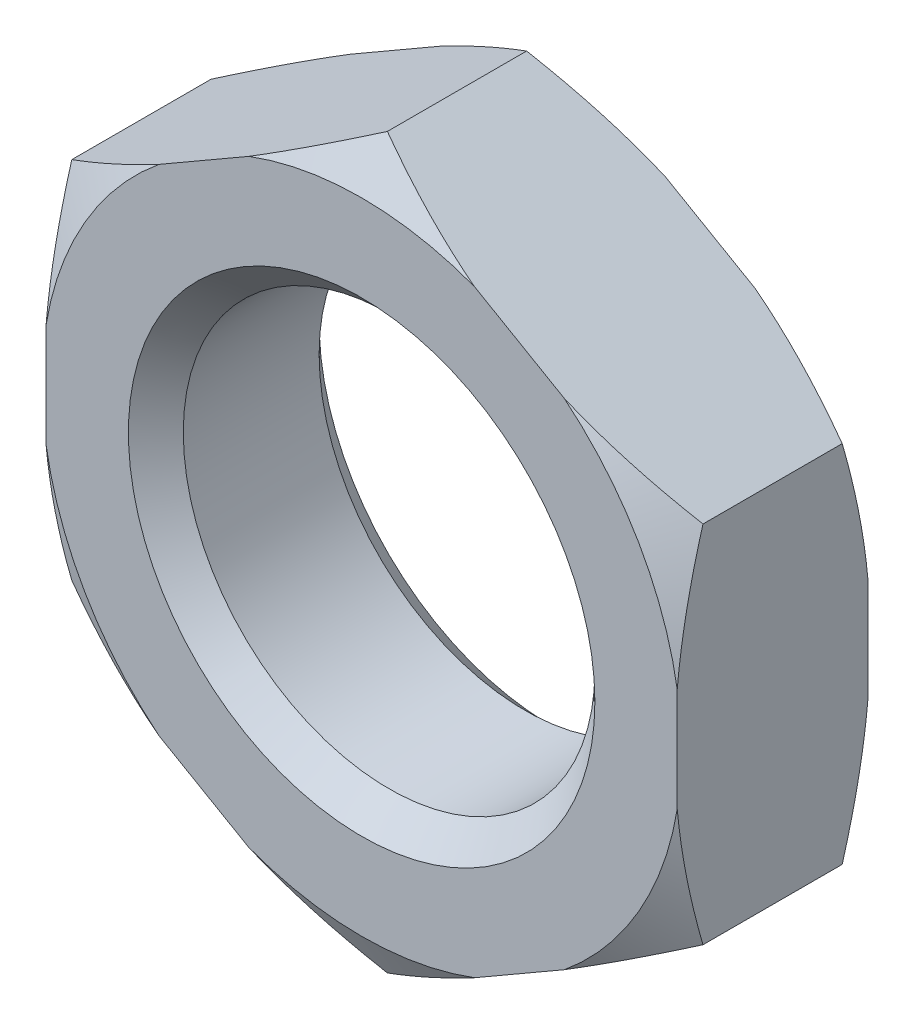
ISO-10303-21;
HEADER;
FILE_DESCRIPTION(('STEP AP214'),'2;1');
FILE_NAME('part.step','',(''),(''),'','','');
FILE_SCHEMA(('AUTOMOTIVE_DESIGN { 1 0 10303 214 1 1 1 1 }'));
ENDSEC;
DATA;
#1=APPLICATION_CONTEXT('core data for automotive mechanical design processes');
#2=APPLICATION_PROTOCOL_DEFINITION('international standard','automotive_design',2000,#1);
#3=PRODUCT_CONTEXT('',#1,'mechanical');
#4=PRODUCT('Part','Part','',(#3));
#5=PRODUCT_RELATED_PRODUCT_CATEGORY('part','',(#4));
#6=PRODUCT_DEFINITION_FORMATION('','',#4);
#7=PRODUCT_DEFINITION_CONTEXT('part definition',#1,'design');
#8=PRODUCT_DEFINITION('design','',#6,#7);
#9=PRODUCT_DEFINITION_SHAPE('','',#8);
#10=(LENGTH_UNIT() NAMED_UNIT(*) SI_UNIT(.MILLI.,.METRE.));
#11=(NAMED_UNIT(*) PLANE_ANGLE_UNIT() SI_UNIT($,.RADIAN.));
#12=(NAMED_UNIT(*) SI_UNIT($,.STERADIAN.) SOLID_ANGLE_UNIT());
#13=UNCERTAINTY_MEASURE_WITH_UNIT(LENGTH_MEASURE(1.E-05),#10,'distance_accuracy_value','');
#14=(GEOMETRIC_REPRESENTATION_CONTEXT(3) GLOBAL_UNCERTAINTY_ASSIGNED_CONTEXT((#13)) GLOBAL_UNIT_ASSIGNED_CONTEXT((#10,
#11,#12)) REPRESENTATION_CONTEXT('',''));
#15=CARTESIAN_POINT('',(0.,0.,0.));
#16=DIRECTION('',(0.,0.,1.));
#17=DIRECTION('',(1.,0.,0.));
#18=AXIS2_PLACEMENT_3D('',#15,#16,#17);
#19=CARTESIAN_POINT('',(23.,13.2790561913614,6.95));
#20=DIRECTION('',(-0.5,-0.866025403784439,0.));
#21=DIRECTION('',(0.866025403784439,-0.5,0.));
#22=AXIS2_PLACEMENT_3D('',#19,#20,#21);
#23=PLANE('',#22);
#24=CARTESIAN_POINT('',(-15.9747891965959,35.781161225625,2.21668125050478));
#25=CARTESIAN_POINT('',(-15.6134641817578,35.5725501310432,2.02166062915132));
#26=CARTESIAN_POINT('',(-15.251701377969,35.363686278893,1.82772222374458));
#27=CARTESIAN_POINT('',(-14.527223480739,34.9454087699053,1.44222167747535));
#28=CARTESIAN_POINT('',(-14.1645083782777,34.7359951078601,1.25065955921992));
#29=CARTESIAN_POINT('',(-13.0747452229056,34.1068200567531,0.679816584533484));
#30=CARTESIAN_POINT('',(-12.3461634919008,33.6861731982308,0.304424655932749));
#31=CARTESIAN_POINT('',(-10.8819184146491,32.84079090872,-0.435063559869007));
#32=CARTESIAN_POINT('',(-10.1462398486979,32.416046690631,-0.799119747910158));
#33=CARTESIAN_POINT('',(-8.66937230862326,31.5633768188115,-1.51198285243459));
#34=CARTESIAN_POINT('',(-7.92818351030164,31.1354512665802,-1.86079025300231));
#35=CARTESIAN_POINT('',(-6.42047462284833,30.2649751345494,-2.54844753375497));
#36=CARTESIAN_POINT('',(-5.65378988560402,29.8223294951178,-2.88681815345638));
#37=CARTESIAN_POINT('',(-4.11268042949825,28.9325695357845,-3.5394669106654));
#38=CARTESIAN_POINT('',(-3.33825533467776,28.4854549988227,-3.85374387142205));
#39=CARTESIAN_POINT('',(-1.78152012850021,27.5866735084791,-4.45222036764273));
#40=CARTESIAN_POINT('',(-0.999218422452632,27.135011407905,-4.73644887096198));
#41=CARTESIAN_POINT('',(0.574675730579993,26.2263231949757,-5.26828511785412));
#42=CARTESIAN_POINT('',(1.36626696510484,25.7692977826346,-5.51589758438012));
#43=CARTESIAN_POINT('',(2.71080604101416,24.9930277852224,-5.89635562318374));
#44=CARTESIAN_POINT('',(3.26126646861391,24.6752193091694,-6.04092236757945));
#45=CARTESIAN_POINT('',(4.36650850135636,24.0371075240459,-6.30618142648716));
#46=CARTESIAN_POINT('',(4.92129001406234,23.7168042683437,-6.42687425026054));
#47=CARTESIAN_POINT('',(6.03458123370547,23.0740452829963,-6.64165739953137));
#48=CARTESIAN_POINT('',(6.593089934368,22.751590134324,-6.73575462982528));
#49=CARTESIAN_POINT('',(7.71321912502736,22.1048832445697,-6.89496841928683));
#50=CARTESIAN_POINT('',(8.27483958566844,21.7806315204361,-6.96008525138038));
#51=CARTESIAN_POINT('',(9.39360548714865,21.1347117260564,-7.05890104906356));
#52=CARTESIAN_POINT('',(9.95072714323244,20.813057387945,-7.09295613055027));
#53=CARTESIAN_POINT('',(11.0657460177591,20.1693009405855,-7.12992128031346));
#54=CARTESIAN_POINT('',(11.623643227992,19.8471988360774,-7.13283167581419));
#55=CARTESIAN_POINT('',(12.7389327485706,19.203286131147,-7.10741538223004));
#56=CARTESIAN_POINT('',(13.2963250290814,18.8814755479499,-7.07908695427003));
#57=CARTESIAN_POINT('',(14.4093162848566,18.2388897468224,-6.99205266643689));
#58=CARTESIAN_POINT('',(14.9649152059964,17.9181145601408,-6.93334589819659));
#59=CARTESIAN_POINT('',(16.2771146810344,17.1605158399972,-6.76030661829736));
#60=CARTESIAN_POINT('',(17.0324867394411,16.7244015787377,-6.63345679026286));
#61=CARTESIAN_POINT('',(18.5361378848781,15.8562681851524,-6.33187182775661));
#62=CARTESIAN_POINT('',(19.2844146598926,15.4242503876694,-6.15712160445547));
#63=CARTESIAN_POINT('',(20.7736014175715,14.5644680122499,-5.76635535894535));
#64=CARTESIAN_POINT('',(21.5145026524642,14.1367084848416,-5.55029534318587));
#65=CARTESIAN_POINT('',(22.9879614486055,13.2860066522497,-5.08371928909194));
#66=CARTESIAN_POINT('',(23.720519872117,12.8630638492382,-4.83320684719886));
#67=CARTESIAN_POINT('',(25.1865297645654,12.0166626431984,-4.3005093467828));
#68=CARTESIAN_POINT('',(25.9198870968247,11.5932585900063,-4.0179812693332));
#69=CARTESIAN_POINT('',(27.3788320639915,10.7509363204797,-3.42917616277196));
#70=CARTESIAN_POINT('',(28.1044244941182,10.3320153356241,-3.12291488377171));
#71=CARTESIAN_POINT('',(29.5489532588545,9.49801626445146,-2.49087030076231));
#72=CARTESIAN_POINT('',(30.2678913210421,9.0829371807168,-2.1650922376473));
#73=CARTESIAN_POINT('',(31.7002116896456,8.25598663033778,-1.49737747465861));
#74=CARTESIAN_POINT('',(32.4135932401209,7.84411560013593,-1.15543861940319));
#75=CARTESIAN_POINT('',(33.6187984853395,7.14829002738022,-0.564461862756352));
#76=CARTESIAN_POINT('',(34.1118935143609,6.86360147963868,-0.318866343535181));
#77=CARTESIAN_POINT('',(35.0959178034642,6.29547479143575,0.177991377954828));
#78=CARTESIAN_POINT('',(35.5868471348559,6.01203660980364,0.429253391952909));
#79=CARTESIAN_POINT('',(36.5615831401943,5.4492725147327,0.934092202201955));
#80=CARTESIAN_POINT('',(37.0454102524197,5.16993480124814,1.18761646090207));
#81=CARTESIAN_POINT('',(38.0113463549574,4.612251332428,1.6990194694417));
#82=CARTESIAN_POINT('',(38.4934553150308,4.33390559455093,1.95689829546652));
#83=CARTESIAN_POINT('',(38.9747891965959,4.05600734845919,2.21668125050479));
#84=B_SPLINE_CURVE_WITH_KNOTS('',3,(#24,#25,#26,#27,#28,#29,#30,#31,#32,#33,#34,#35,#36,#37,#38,
#39,#40,#41,#42,#43,#44,#45,#46,#47,#48,#49,#50,#51,#52,#53,#54,#55,#56,#57,#58,#59,#60,#61,#62,
#63,#64,#65,#66,#67,#68,#69,#70,#71,#72,#73,#74,#75,#76,#77,#78,#79,#80,#81,#82,#83),
.UNSPECIFIED.,.F.,.F.,(4,2,2,2,2,2,2,2,2,2,2,2,2,2,2,2,2,2,2,2,2,2,2,2,2,2,2,2,2,4),(0.,
1.38165067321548,2.76331448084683,5.52696407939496,8.29947936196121,11.0719065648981,
13.9148838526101,16.7579999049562,19.5983496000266,22.4383326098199,24.3934941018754,
26.3486138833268,28.3032256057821,30.2578189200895,32.1897107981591,34.1215823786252,
36.0535615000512,37.9855983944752,40.6282126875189,43.2716603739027,45.9179390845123,
48.5639417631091,51.2415955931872,53.91748741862,56.5926638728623,59.2681981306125,
61.1284279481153,62.9885960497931,64.8291026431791,66.6696414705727),.UNSPECIFIED.);
#85=CARTESIAN_POINT('',(0.,26.5581123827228,-5.07361162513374));
#86=VERTEX_POINT('',#85);
#87=CARTESIAN_POINT('',(8.22874991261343,21.8072414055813,-6.95));
#88=VERTEX_POINT('',#87);
#89=EDGE_CURVE('E177',#86,#88,#84,.T.);
#90=ORIENTED_EDGE('',*,*,#89,.F.);
#91=DIRECTION('',(0.,0.,-1.));
#92=VECTOR('',#91,1.);
#93=CARTESIAN_POINT('',(0.,26.5581123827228,6.95));
#94=LINE('',#93,#92);
#95=CARTESIAN_POINT('',(0.,26.5581123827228,5.07361162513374));
#96=VERTEX_POINT('',#95);
#97=EDGE_CURVE('E223',#96,#86,#94,.T.);
#98=ORIENTED_EDGE('',*,*,#97,.F.);
#99=CARTESIAN_POINT('',(38.9747891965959,4.05600734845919,-2.21668125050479));
#100=CARTESIAN_POINT('',(38.6134641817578,4.26461844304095,-2.02166062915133));
#101=CARTESIAN_POINT('',(38.251701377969,4.47348229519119,-1.82772222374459));
#102=CARTESIAN_POINT('',(37.527223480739,4.89175980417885,-1.44222167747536));
#103=CARTESIAN_POINT('',(37.1645083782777,5.10117346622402,-1.25065955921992));
#104=CARTESIAN_POINT('',(36.0747452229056,5.73034851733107,-0.679816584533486));
#105=CARTESIAN_POINT('',(35.3461634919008,6.15099537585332,-0.304424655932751));
#106=CARTESIAN_POINT('',(33.8819184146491,6.99637766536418,0.435063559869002));
#107=CARTESIAN_POINT('',(33.1462398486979,7.42112188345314,0.799119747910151));
#108=CARTESIAN_POINT('',(31.6693723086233,8.27379175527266,1.51198285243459));
#109=CARTESIAN_POINT('',(30.9281835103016,8.70171730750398,1.8607902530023));
#110=CARTESIAN_POINT('',(29.4204746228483,9.57219343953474,2.54844753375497));
#111=CARTESIAN_POINT('',(28.653789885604,10.0148390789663,2.88681815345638));
#112=CARTESIAN_POINT('',(27.1126804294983,10.9045990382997,3.5394669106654));
#113=CARTESIAN_POINT('',(26.3382553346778,11.3517135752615,3.85374387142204));
#114=CARTESIAN_POINT('',(24.7815201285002,12.250495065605,4.45222036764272));
#115=CARTESIAN_POINT('',(23.9992184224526,12.7021571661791,4.73644887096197));
#116=CARTESIAN_POINT('',(22.42532426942,13.6108453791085,5.26828511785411));
#117=CARTESIAN_POINT('',(21.6337330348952,14.0678707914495,5.51589758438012));
#118=CARTESIAN_POINT('',(20.2891939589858,14.8441407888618,5.89635562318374));
#119=CARTESIAN_POINT('',(19.7387335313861,15.1619492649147,6.04092236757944));
#120=CARTESIAN_POINT('',(18.6334914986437,15.8000610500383,6.30618142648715));
#121=CARTESIAN_POINT('',(18.0787099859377,16.1203643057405,6.42687425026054));
#122=CARTESIAN_POINT('',(16.9654187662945,16.7631232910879,6.64165739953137));
#123=CARTESIAN_POINT('',(16.406910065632,17.0855784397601,6.73575462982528));
#124=CARTESIAN_POINT('',(15.2867808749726,17.7322853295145,6.89496841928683));
#125=CARTESIAN_POINT('',(14.7251604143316,18.056537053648,6.96008525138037));
#126=CARTESIAN_POINT('',(13.6063945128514,18.7024568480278,7.05890104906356));
#127=CARTESIAN_POINT('',(13.0492728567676,19.0241111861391,7.09295613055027));
#128=CARTESIAN_POINT('',(11.9342539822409,19.6678676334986,7.12992128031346));
#129=CARTESIAN_POINT('',(11.376356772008,19.9899697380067,7.13283167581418));
#130=CARTESIAN_POINT('',(10.2610672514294,20.6338824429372,7.10741538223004));
#131=CARTESIAN_POINT('',(9.70367497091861,20.9556930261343,7.07908695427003));
#132=CARTESIAN_POINT('',(8.5906837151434,21.5982788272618,6.99205266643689));
#133=CARTESIAN_POINT('',(8.03508479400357,21.9190540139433,6.9333458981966));
#134=CARTESIAN_POINT('',(6.72288531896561,22.676652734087,6.76030661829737));
#135=CARTESIAN_POINT('',(5.96751326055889,23.1127669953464,6.63345679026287));
#136=CARTESIAN_POINT('',(4.46386211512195,23.9809003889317,6.33187182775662));
#137=CARTESIAN_POINT('',(3.71558534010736,24.4129181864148,6.15712160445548));
#138=CARTESIAN_POINT('',(2.22639858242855,25.2727005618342,5.76635535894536));
#139=CARTESIAN_POINT('',(1.48549734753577,25.7004600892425,5.55029534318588));
#140=CARTESIAN_POINT('',(0.0120385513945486,26.5511619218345,5.08371928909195));
#141=CARTESIAN_POINT('',(-0.720519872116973,26.974104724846,4.83320684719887));
#142=CARTESIAN_POINT('',(-2.18652976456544,27.8205059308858,4.30050934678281));
#143=CARTESIAN_POINT('',(-2.91988709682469,28.2439099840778,4.01798126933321));
#144=CARTESIAN_POINT('',(-4.37883206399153,29.0862322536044,3.42917616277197));
#145=CARTESIAN_POINT('',(-5.10442449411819,29.50515323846,3.12291488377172));
#146=CARTESIAN_POINT('',(-6.54895325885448,30.3391523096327,2.49087030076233));
#147=CARTESIAN_POINT('',(-7.26789132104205,30.7542313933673,2.16509223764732));
#148=CARTESIAN_POINT('',(-8.70021168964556,31.5811819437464,1.49737747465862));
#149=CARTESIAN_POINT('',(-9.4135932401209,31.9930529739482,1.15543861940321));
#150=CARTESIAN_POINT('',(-10.6187984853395,32.6888785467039,0.564461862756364));
#151=CARTESIAN_POINT('',(-11.1118935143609,32.9735670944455,0.318866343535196));
#152=CARTESIAN_POINT('',(-12.0959178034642,33.5416937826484,-0.177991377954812));
#153=CARTESIAN_POINT('',(-12.5868471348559,33.8251319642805,-0.429253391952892));
#154=CARTESIAN_POINT('',(-13.5615831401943,34.3878960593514,-0.934092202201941));
#155=CARTESIAN_POINT('',(-14.0454102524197,34.667233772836,-1.18761646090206));
#156=CARTESIAN_POINT('',(-15.0113463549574,35.2249172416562,-1.69901946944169));
#157=CARTESIAN_POINT('',(-15.4934553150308,35.5032629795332,-1.95689829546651));
#158=CARTESIAN_POINT('',(-15.9747891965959,35.781161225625,-2.21668125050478));
#159=B_SPLINE_CURVE_WITH_KNOTS('',3,(#99,#100,#101,#102,#103,#104,#105,#106,#107,#108,#109,#110,
#111,#112,#113,#114,#115,#116,#117,#118,#119,#120,#121,#122,#123,#124,#125,#126,#127,#128,#129,
#130,#131,#132,#133,#134,#135,#136,#137,#138,#139,#140,#141,#142,#143,#144,#145,#146,#147,#148,
#149,#150,#151,#152,#153,#154,#155,#156,#157,#158),.UNSPECIFIED.,.F.,.F.,(4,2,2,2,2,2,2,2,2,2,2,
2,2,2,2,2,2,2,2,2,2,2,2,2,2,2,2,2,2,4),(0.,1.38165067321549,2.76331448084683,5.52696407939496,
8.29947936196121,11.0719065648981,13.91488385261,16.7579999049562,19.5983496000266,
22.4383326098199,24.3934941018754,26.3486138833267,28.3032256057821,30.2578189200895,
32.1897107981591,34.1215823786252,36.0535615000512,37.9855983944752,40.6282126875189,
43.2716603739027,45.9179390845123,48.5639417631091,51.2415955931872,53.91748741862,
56.5926638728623,59.2681981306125,61.1284279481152,62.9885960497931,64.8291026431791,
66.6696414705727),.UNSPECIFIED.);
#160=CARTESIAN_POINT('',(8.22874991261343,21.8072414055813,6.95));
#161=VERTEX_POINT('',#160);
#162=EDGE_CURVE('E372',#161,#96,#159,.T.);
#163=ORIENTED_EDGE('',*,*,#162,.F.);
#164=DIRECTION('',(-0.866025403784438,0.5,0.));
#165=VECTOR('',#164,1.);
#166=CARTESIAN_POINT('',(23.,13.2790561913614,6.95));
#167=LINE('',#166,#165);
#168=CARTESIAN_POINT('',(14.7712500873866,18.0299271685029,6.95));
#169=VERTEX_POINT('',#168);
#170=EDGE_CURVE('E351',#169,#161,#167,.T.);
#171=ORIENTED_EDGE('',*,*,#170,.F.);
#172=CARTESIAN_POINT('',(23.,13.2790561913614,5.07361162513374));
#173=VERTEX_POINT('',#172);
#174=EDGE_CURVE('E194',#173,#169,#159,.T.);
#175=ORIENTED_EDGE('',*,*,#174,.F.);
#176=DIRECTION('',(0.,0.,-1.));
#177=VECTOR('',#176,1.);
#178=CARTESIAN_POINT('',(23.,13.2790561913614,6.95));
#179=LINE('',#178,#177);
#180=CARTESIAN_POINT('',(23.,13.2790561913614,-5.07361162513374));
#181=VERTEX_POINT('',#180);
#182=EDGE_CURVE('E183',#173,#181,#179,.T.);
#183=ORIENTED_EDGE('',*,*,#182,.T.);
#184=CARTESIAN_POINT('',(14.7712500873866,18.0299271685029,-6.95));
#185=VERTEX_POINT('',#184);
#186=EDGE_CURVE('E164',#185,#181,#84,.T.);
#187=ORIENTED_EDGE('',*,*,#186,.F.);
#188=DIRECTION('',(-0.866025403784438,0.5,0.));
#189=VECTOR('',#188,1.);
#190=CARTESIAN_POINT('',(23.,13.2790561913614,-6.95));
#191=LINE('',#190,#189);
#192=EDGE_CURVE('E265',#185,#88,#191,.T.);
#193=ORIENTED_EDGE('',*,*,#192,.T.);
#194=EDGE_LOOP('',(#90,#98,#163,#171,#175,#183,#187,#193));
#195=FACE_BOUND('',#194,.T.);
#196=ADVANCED_FACE('F39',(#195),#23,.F.);
#197=CARTESIAN_POINT('',(0.,26.5581123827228,6.95));
#198=DIRECTION('',(0.5,-0.866025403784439,0.));
#199=DIRECTION('',(0.866025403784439,0.5,0.));
#200=AXIS2_PLACEMENT_3D('',#197,#198,#199);
#201=PLANE('',#200);
#202=CARTESIAN_POINT('',(-38.9747891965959,4.05600734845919,2.21668125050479));
#203=CARTESIAN_POINT('',(-38.6134641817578,4.26461844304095,2.02166062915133));
#204=CARTESIAN_POINT('',(-38.251701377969,4.47348229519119,1.8277222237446));
#205=CARTESIAN_POINT('',(-37.527223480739,4.89175980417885,1.44222167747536));
#206=CARTESIAN_POINT('',(-37.1645083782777,5.10117346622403,1.25065955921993));
#207=CARTESIAN_POINT('',(-36.0747452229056,5.73034851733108,0.67981658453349));
#208=CARTESIAN_POINT('',(-35.3461634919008,6.15099537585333,0.304424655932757));
#209=CARTESIAN_POINT('',(-33.8819184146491,6.99637766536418,-0.435063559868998));
#210=CARTESIAN_POINT('',(-33.1462398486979,7.42112188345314,-0.799119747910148));
#211=CARTESIAN_POINT('',(-31.6693723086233,8.27379175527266,-1.51198285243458));
#212=CARTESIAN_POINT('',(-30.9281835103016,8.70171730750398,-1.8607902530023));
#213=CARTESIAN_POINT('',(-29.4204746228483,9.57219343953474,-2.54844753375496));
#214=CARTESIAN_POINT('',(-28.653789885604,10.0148390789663,-2.88681815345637));
#215=CARTESIAN_POINT('',(-27.1126804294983,10.9045990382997,-3.5394669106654));
#216=CARTESIAN_POINT('',(-26.3382553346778,11.3517135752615,-3.85374387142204));
#217=CARTESIAN_POINT('',(-24.7815201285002,12.250495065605,-4.45222036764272));
#218=CARTESIAN_POINT('',(-23.9992184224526,12.7021571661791,-4.73644887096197));
#219=CARTESIAN_POINT('',(-22.42532426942,13.6108453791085,-5.26828511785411));
#220=CARTESIAN_POINT('',(-21.6337330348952,14.0678707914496,-5.51589758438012));
#221=CARTESIAN_POINT('',(-20.2891939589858,14.8441407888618,-5.89635562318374));
#222=CARTESIAN_POINT('',(-19.7387335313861,15.1619492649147,-6.04092236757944));
#223=CARTESIAN_POINT('',(-18.6334914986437,15.8000610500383,-6.30618142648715));
#224=CARTESIAN_POINT('',(-18.0787099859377,16.1203643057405,-6.42687425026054));
#225=CARTESIAN_POINT('',(-16.9654187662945,16.7631232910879,-6.64165739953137));
#226=CARTESIAN_POINT('',(-16.406910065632,17.0855784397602,-6.73575462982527));
#227=CARTESIAN_POINT('',(-15.2867808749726,17.7322853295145,-6.89496841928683));
#228=CARTESIAN_POINT('',(-14.7251604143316,18.056537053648,-6.96008525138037));
#229=CARTESIAN_POINT('',(-13.6063945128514,18.7024568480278,-7.05890104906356));
#230=CARTESIAN_POINT('',(-13.0492728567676,19.0241111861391,-7.09295613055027));
#231=CARTESIAN_POINT('',(-11.9342539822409,19.6678676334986,-7.12992128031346));
#232=CARTESIAN_POINT('',(-11.376356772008,19.9899697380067,-7.13283167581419));
#233=CARTESIAN_POINT('',(-10.2610672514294,20.6338824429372,-7.10741538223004));
#234=CARTESIAN_POINT('',(-9.70367497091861,20.9556930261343,-7.07908695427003));
#235=CARTESIAN_POINT('',(-8.5906837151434,21.5982788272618,-6.99205266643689));
#236=CARTESIAN_POINT('',(-8.03508479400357,21.9190540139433,-6.9333458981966));
#237=CARTESIAN_POINT('',(-6.72288531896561,22.676652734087,-6.76030661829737));
#238=CARTESIAN_POINT('',(-5.96751326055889,23.1127669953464,-6.63345679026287));
#239=CARTESIAN_POINT('',(-4.46386211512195,23.9809003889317,-6.33187182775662));
#240=CARTESIAN_POINT('',(-3.71558534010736,24.4129181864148,-6.15712160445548));
#241=CARTESIAN_POINT('',(-2.22639858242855,25.2727005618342,-5.76635535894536));
#242=CARTESIAN_POINT('',(-1.48549734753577,25.7004600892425,-5.55029534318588));
#243=CARTESIAN_POINT('',(-0.0120385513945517,26.5511619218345,-5.08371928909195));
#244=CARTESIAN_POINT('',(0.72051987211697,26.974104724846,-4.83320684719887));
#245=CARTESIAN_POINT('',(2.18652976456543,27.8205059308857,-4.30050934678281));
#246=CARTESIAN_POINT('',(2.91988709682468,28.2439099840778,-4.01798126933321));
#247=CARTESIAN_POINT('',(4.37883206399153,29.0862322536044,-3.42917616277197));
#248=CARTESIAN_POINT('',(5.10442449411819,29.50515323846,-3.12291488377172));
#249=CARTESIAN_POINT('',(6.54895325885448,30.3391523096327,-2.49087030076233));
#250=CARTESIAN_POINT('',(7.26789132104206,30.7542313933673,-2.16509223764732));
#251=CARTESIAN_POINT('',(8.70021168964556,31.5811819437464,-1.49737747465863));
#252=CARTESIAN_POINT('',(9.4135932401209,31.9930529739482,-1.15543861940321));
#253=CARTESIAN_POINT('',(10.6187984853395,32.6888785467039,-0.564461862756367));
#254=CARTESIAN_POINT('',(11.1118935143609,32.9735670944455,-0.318866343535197));
#255=CARTESIAN_POINT('',(12.0959178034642,33.5416937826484,0.177991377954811));
#256=CARTESIAN_POINT('',(12.5868471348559,33.8251319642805,0.42925339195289));
#257=CARTESIAN_POINT('',(13.5615831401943,34.3878960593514,0.934092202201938));
#258=CARTESIAN_POINT('',(14.0454102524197,34.667233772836,1.18761646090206));
#259=CARTESIAN_POINT('',(15.0113463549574,35.2249172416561,1.69901946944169));
#260=CARTESIAN_POINT('',(15.4934553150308,35.5032629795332,1.95689829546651));
#261=CARTESIAN_POINT('',(15.974789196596,35.781161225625,2.21668125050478));
#262=B_SPLINE_CURVE_WITH_KNOTS('',3,(#202,#203,#204,#205,#206,#207,#208,#209,#210,#211,#212,
#213,#214,#215,#216,#217,#218,#219,#220,#221,#222,#223,#224,#225,#226,#227,#228,#229,#230,#231,
#232,#233,#234,#235,#236,#237,#238,#239,#240,#241,#242,#243,#244,#245,#246,#247,#248,#249,#250,
#251,#252,#253,#254,#255,#256,#257,#258,#259,#260,#261),.UNSPECIFIED.,.F.,.F.,(4,2,2,2,2,2,2,2,
2,2,2,2,2,2,2,2,2,2,2,2,2,2,2,2,2,2,2,2,2,4),(0.,1.38165067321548,2.76331448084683,
5.52696407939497,8.29947936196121,11.0719065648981,13.91488385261,16.7579999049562,
19.5983496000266,22.4383326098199,24.3934941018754,26.3486138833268,28.3032256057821,
30.2578189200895,32.1897107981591,34.1215823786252,36.0535615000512,37.9855983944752,
40.6282126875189,43.2716603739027,45.9179390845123,48.5639417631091,51.2415955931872,
53.91748741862,56.5926638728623,59.2681981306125,61.1284279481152,62.9885960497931,
64.8291026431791,66.6696414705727),.UNSPECIFIED.);
#263=CARTESIAN_POINT('',(-23.,13.2790561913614,-5.07361162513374));
#264=VERTEX_POINT('',#263);
#265=CARTESIAN_POINT('',(-14.7712500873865,18.0299271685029,-6.95));
#266=VERTEX_POINT('',#265);
#267=EDGE_CURVE('E55',#264,#266,#262,.T.);
#268=ORIENTED_EDGE('',*,*,#267,.F.);
#269=DIRECTION('',(0.,0.,-1.));
#270=VECTOR('',#269,1.);
#271=CARTESIAN_POINT('',(-23.,13.2790561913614,6.95));
#272=LINE('',#271,#270);
#273=CARTESIAN_POINT('',(-23.,13.2790561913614,5.07361162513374));
#274=VERTEX_POINT('',#273);
#275=EDGE_CURVE('E219',#274,#264,#272,.T.);
#276=ORIENTED_EDGE('',*,*,#275,.F.);
#277=CARTESIAN_POINT('',(15.974789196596,35.781161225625,-2.21668125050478));
#278=CARTESIAN_POINT('',(15.6134641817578,35.5725501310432,-2.02166062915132));
#279=CARTESIAN_POINT('',(15.251701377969,35.363686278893,-1.82772222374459));
#280=CARTESIAN_POINT('',(14.527223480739,34.9454087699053,-1.44222167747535));
#281=CARTESIAN_POINT('',(14.1645083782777,34.7359951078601,-1.25065955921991));
#282=CARTESIAN_POINT('',(13.0747452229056,34.1068200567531,-0.679816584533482));
#283=CARTESIAN_POINT('',(12.3461634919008,33.6861731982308,-0.304424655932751));
#284=CARTESIAN_POINT('',(10.8819184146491,32.84079090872,0.435063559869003));
#285=CARTESIAN_POINT('',(10.1462398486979,32.416046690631,0.799119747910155));
#286=CARTESIAN_POINT('',(8.66937230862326,31.5633768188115,1.51198285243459));
#287=CARTESIAN_POINT('',(7.92818351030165,31.1354512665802,1.86079025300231));
#288=CARTESIAN_POINT('',(6.42047462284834,30.2649751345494,2.54844753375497));
#289=CARTESIAN_POINT('',(5.65378988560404,29.8223294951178,2.88681815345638));
#290=CARTESIAN_POINT('',(4.11268042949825,28.9325695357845,3.5394669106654));
#291=CARTESIAN_POINT('',(3.33825533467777,28.4854549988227,3.85374387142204));
#292=CARTESIAN_POINT('',(1.78152012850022,27.5866735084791,4.45222036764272));
#293=CARTESIAN_POINT('',(0.999218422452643,27.135011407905,4.73644887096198));
#294=CARTESIAN_POINT('',(-0.574675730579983,26.2263231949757,5.26828511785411));
#295=CARTESIAN_POINT('',(-1.36626696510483,25.7692977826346,5.51589758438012));
#296=CARTESIAN_POINT('',(-2.71080604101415,24.9930277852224,5.89635562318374));
#297=CARTESIAN_POINT('',(-3.2612664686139,24.6752193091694,6.04092236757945));
#298=CARTESIAN_POINT('',(-4.36650850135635,24.0371075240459,6.30618142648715));
#299=CARTESIAN_POINT('',(-4.92129001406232,23.7168042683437,6.42687425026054));
#300=CARTESIAN_POINT('',(-6.03458123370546,23.0740452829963,6.64165739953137));
#301=CARTESIAN_POINT('',(-6.59308993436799,22.751590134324,6.73575462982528));
#302=CARTESIAN_POINT('',(-7.71321912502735,22.1048832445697,6.89496841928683));
#303=CARTESIAN_POINT('',(-8.27483958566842,21.7806315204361,6.96008525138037));
#304=CARTESIAN_POINT('',(-9.39360548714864,21.1347117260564,7.05890104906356));
#305=CARTESIAN_POINT('',(-9.95072714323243,20.813057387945,7.09295613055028));
#306=CARTESIAN_POINT('',(-11.0657460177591,20.1693009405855,7.12992128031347));
#307=CARTESIAN_POINT('',(-11.623643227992,19.8471988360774,7.13283167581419));
#308=CARTESIAN_POINT('',(-12.7389327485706,19.203286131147,7.10741538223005));
#309=CARTESIAN_POINT('',(-13.2963250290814,18.8814755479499,7.07908695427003));
#310=CARTESIAN_POINT('',(-14.4093162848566,18.2388897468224,6.99205266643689));
#311=CARTESIAN_POINT('',(-14.9649152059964,17.9181145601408,6.9333458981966));
#312=CARTESIAN_POINT('',(-16.2771146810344,17.1605158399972,6.76030661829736));
#313=CARTESIAN_POINT('',(-17.0324867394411,16.7244015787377,6.63345679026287));
#314=CARTESIAN_POINT('',(-18.536137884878,15.8562681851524,6.33187182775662));
#315=CARTESIAN_POINT('',(-19.2844146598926,15.4242503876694,6.15712160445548));
#316=CARTESIAN_POINT('',(-20.7736014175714,14.5644680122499,5.76635535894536));
#317=CARTESIAN_POINT('',(-21.5145026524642,14.1367084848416,5.55029534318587));
#318=CARTESIAN_POINT('',(-22.9879614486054,13.2860066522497,5.08371928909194));
#319=CARTESIAN_POINT('',(-23.720519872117,12.8630638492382,4.83320684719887));
#320=CARTESIAN_POINT('',(-25.1865297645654,12.0166626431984,4.30050934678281));
#321=CARTESIAN_POINT('',(-25.9198870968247,11.5932585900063,4.01798126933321));
#322=CARTESIAN_POINT('',(-27.3788320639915,10.7509363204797,3.42917616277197));
#323=CARTESIAN_POINT('',(-28.1044244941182,10.3320153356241,3.12291488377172));
#324=CARTESIAN_POINT('',(-29.5489532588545,9.49801626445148,2.49087030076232));
#325=CARTESIAN_POINT('',(-30.2678913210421,9.08293718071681,2.16509223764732));
#326=CARTESIAN_POINT('',(-31.7002116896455,8.2559866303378,1.49737747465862));
#327=CARTESIAN_POINT('',(-32.4135932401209,7.84411560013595,1.15543861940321));
#328=CARTESIAN_POINT('',(-33.6187984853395,7.14829002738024,0.564461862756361));
#329=CARTESIAN_POINT('',(-34.1118935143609,6.8636014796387,0.318866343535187));
#330=CARTESIAN_POINT('',(-35.0959178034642,6.29547479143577,-0.177991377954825));
#331=CARTESIAN_POINT('',(-35.5868471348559,6.01203660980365,-0.429253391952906));
#332=CARTESIAN_POINT('',(-36.5615831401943,5.44927251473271,-0.934092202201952));
#333=CARTESIAN_POINT('',(-37.0454102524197,5.16993480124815,-1.18761646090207));
#334=CARTESIAN_POINT('',(-38.0113463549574,4.61225133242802,-1.6990194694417));
#335=CARTESIAN_POINT('',(-38.4934553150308,4.33390559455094,-1.95689829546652));
#336=CARTESIAN_POINT('',(-38.9747891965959,4.05600734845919,-2.21668125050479));
#337=B_SPLINE_CURVE_WITH_KNOTS('',3,(#277,#278,#279,#280,#281,#282,#283,#284,#285,#286,#287,
#288,#289,#290,#291,#292,#293,#294,#295,#296,#297,#298,#299,#300,#301,#302,#303,#304,#305,#306,
#307,#308,#309,#310,#311,#312,#313,#314,#315,#316,#317,#318,#319,#320,#321,#322,#323,#324,#325,
#326,#327,#328,#329,#330,#331,#332,#333,#334,#335,#336),.UNSPECIFIED.,.F.,.F.,(4,2,2,2,2,2,2,2,
2,2,2,2,2,2,2,2,2,2,2,2,2,2,2,2,2,2,2,2,2,4),(0.,1.38165067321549,2.76331448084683,
5.52696407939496,8.29947936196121,11.0719065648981,13.91488385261,16.7579999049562,
19.5983496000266,22.4383326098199,24.3934941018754,26.3486138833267,28.3032256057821,
30.2578189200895,32.1897107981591,34.1215823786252,36.0535615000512,37.9855983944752,
40.6282126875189,43.2716603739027,45.9179390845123,48.5639417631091,51.2415955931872,
53.91748741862,56.5926638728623,59.2681981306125,61.1284279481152,62.9885960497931,
64.8291026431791,66.6696414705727),.UNSPECIFIED.);
#338=CARTESIAN_POINT('',(-14.7712500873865,18.0299271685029,6.95));
#339=VERTEX_POINT('',#338);
#340=EDGE_CURVE('E344',#339,#274,#337,.T.);
#341=ORIENTED_EDGE('',*,*,#340,.F.);
#342=DIRECTION('',(-0.866025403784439,-0.5,0.));
#343=VECTOR('',#342,1.);
#344=CARTESIAN_POINT('',(0.,26.5581123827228,6.95));
#345=LINE('',#344,#343);
#346=CARTESIAN_POINT('',(-8.22874991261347,21.8072414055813,6.95));
#347=VERTEX_POINT('',#346);
#348=EDGE_CURVE('E355',#347,#339,#345,.T.);
#349=ORIENTED_EDGE('',*,*,#348,.F.);
#350=EDGE_CURVE('E350',#96,#347,#337,.T.);
#351=ORIENTED_EDGE('',*,*,#350,.F.);
#352=ORIENTED_EDGE('',*,*,#97,.T.);
#353=CARTESIAN_POINT('',(-8.22874991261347,21.8072414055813,-6.95));
#354=VERTEX_POINT('',#353);
#355=EDGE_CURVE('E401',#354,#86,#262,.T.);
#356=ORIENTED_EDGE('',*,*,#355,.F.);
#357=DIRECTION('',(-0.866025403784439,-0.5,0.));
#358=VECTOR('',#357,1.);
#359=CARTESIAN_POINT('',(0.,26.5581123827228,-6.95));
#360=LINE('',#359,#358);
#361=EDGE_CURVE('E371',#354,#266,#360,.T.);
#362=ORIENTED_EDGE('',*,*,#361,.T.);
#363=EDGE_LOOP('',(#268,#276,#341,#349,#351,#352,#356,#362));
#364=FACE_BOUND('',#363,.T.);
#365=ADVANCED_FACE('F324',(#364),#201,.F.);
#366=CARTESIAN_POINT('',(-23.,13.2790561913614,6.95));
#367=DIRECTION('',(1.,0.,0.));
#368=DIRECTION('',(0.,0.,-1.));
#369=AXIS2_PLACEMENT_3D('',#366,#367,#368);
#370=PLANE('',#369);
#371=CARTESIAN_POINT('',(-23.,-29.2538453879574,1.07783624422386));
#372=CARTESIAN_POINT('',(-23.,-28.8383770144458,0.889271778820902));
#373=CARTESIAN_POINT('',(-23.,-28.4223346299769,0.701973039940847));
#374=CARTESIAN_POINT('',(-23.,-27.5889998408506,0.330162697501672));
#375=CARTESIAN_POINT('',(-23.,-27.1717074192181,0.145651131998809));
#376=CARTESIAN_POINT('',(-23.,-25.917678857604,-0.403373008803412));
#377=CARTESIAN_POINT('',(-23.,-25.0789307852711,-0.763311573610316));
#378=CARTESIAN_POINT('',(-23.,-23.3917256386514,-1.46990732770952));
#379=CARTESIAN_POINT('',(-23.,-22.5432426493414,-1.81650279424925));
#380=CARTESIAN_POINT('',(-23.,-20.8391057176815,-2.49155128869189));
#381=CARTESIAN_POINT('',(-23.,-19.9834521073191,-2.82000515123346));
#382=CARTESIAN_POINT('',(-23.,-18.2677548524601,-3.45330560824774));
#383=CARTESIAN_POINT('',(-23.,-17.4077478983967,-3.75825111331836));
#384=CARTESIAN_POINT('',(-23.,-15.6785423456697,-4.34120466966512));
#385=CARTESIAN_POINT('',(-23.,-14.8093432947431,-4.61921138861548));
#386=CARTESIAN_POINT('',(-23.,-13.0621643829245,-5.14192267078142));
#387=CARTESIAN_POINT('',(-23.,-12.184197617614,-5.38667068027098));
#388=CARTESIAN_POINT('',(-23.,-10.4181041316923,-5.83631948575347));
#389=CARTESIAN_POINT('',(-23.,-9.52997884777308,-6.04122584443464));
#390=CARTESIAN_POINT('',(-23.,-7.99684396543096,-6.35240422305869));
#391=CARTESIAN_POINT('',(-23.,-7.35416794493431,-6.4701785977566));
#392=CARTESIAN_POINT('',(-23.,-6.06442277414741,-6.67869986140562));
#393=CARTESIAN_POINT('',(-23.,-5.41735376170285,-6.769447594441));
#394=CARTESIAN_POINT('',(-23.,-4.11990528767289,-6.92151653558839));
#395=CARTESIAN_POINT('',(-23.,-3.46952670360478,-6.98284517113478));
#396=CARTESIAN_POINT('',(-23.,-2.16656103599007,-7.07432917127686));
#397=CARTESIAN_POINT('',(-23.,-1.51397395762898,-7.10448460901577));
#398=CARTESIAN_POINT('',(-23.,-0.208435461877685,-7.13268181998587));
#399=CARTESIAN_POINT('',(-23.,0.444515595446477,-7.13074010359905));
#400=CARTESIAN_POINT('',(-23.,1.74952461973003,-7.09484528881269));
#401=CARTESIAN_POINT('',(-23.,2.40158259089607,-7.06089234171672));
#402=CARTESIAN_POINT('',(-23.,3.70339482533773,-6.96201184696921));
#403=CARTESIAN_POINT('',(-23.,4.35314884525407,-6.89708111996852));
#404=CARTESIAN_POINT('',(-23.,5.64906839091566,-6.73811401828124));
#405=CARTESIAN_POINT('',(-23.,6.29523376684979,-6.64407643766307));
#406=CARTESIAN_POINT('',(-23.,7.90516066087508,-6.37559106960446));
#407=CARTESIAN_POINT('',(-23.,8.86615096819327,-6.18444873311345));
#408=CARTESIAN_POINT('',(-23.,10.7766038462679,-5.75131903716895));
#409=CARTESIAN_POINT('',(-23.,11.7260638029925,-5.50932036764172));
#410=CARTESIAN_POINT('',(-23.,13.6153394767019,-4.98303311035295));
#411=CARTESIAN_POINT('',(-23.,14.5551292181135,-4.69865217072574));
#412=CARTESIAN_POINT('',(-23.,16.4236288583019,-4.096058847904));
#413=CARTESIAN_POINT('',(-23.,17.3523395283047,-3.77784883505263));
#414=CARTESIAN_POINT('',(-23.,19.2105193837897,-3.11042350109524));
#415=CARTESIAN_POINT('',(-23.,20.1398751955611,-2.76089453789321));
#416=CARTESIAN_POINT('',(-23.,21.9899018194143,-2.03948813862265));
#417=CARTESIAN_POINT('',(-23.,22.9105720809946,-1.66760929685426));
#418=CARTESIAN_POINT('',(-23.,24.2830789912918,-1.09746398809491));
#419=CARTESIAN_POINT('',(-23.,24.7377529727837,-0.905980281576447));
#420=CARTESIAN_POINT('',(-23.,25.6453895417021,-0.518989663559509));
#421=CARTESIAN_POINT('',(-23.,26.0983521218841,-0.323482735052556));
#422=CARTESIAN_POINT('',(-23.,27.0025836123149,0.0711073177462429));
#423=CARTESIAN_POINT('',(-23.,27.4538529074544,0.270189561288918));
#424=CARTESIAN_POINT('',(-23.,28.3549204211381,0.671635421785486));
#425=CARTESIAN_POINT('',(-23.,28.8047186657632,0.873998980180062));
#426=CARTESIAN_POINT('',(-23.,29.2538453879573,1.07783624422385));
#427=B_SPLINE_CURVE_WITH_KNOTS('',3,(#371,#372,#373,#374,#375,#376,#377,#378,#379,#380,#381,
#382,#383,#384,#385,#386,#387,#388,#389,#390,#391,#392,#393,#394,#395,#396,#397,#398,#399,#400,
#401,#402,#403,#404,#405,#406,#407,#408,#409,#410,#411,#412,#413,#414,#415,#416,#417,#418,#419,
#420,#421,#422,#423,#424,#425,#426),.UNSPECIFIED.,.F.,.F.,(4,2,2,2,2,2,2,2,2,2,2,2,2,2,2,2,2,2,
2,2,2,2,2,2,2,2,2,4),(0.,1.36876728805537,2.73755324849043,5.47558452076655,8.22504691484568,
10.9743827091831,13.7114357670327,16.4486241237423,19.1822017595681,21.9153974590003,
23.8750329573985,25.8346072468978,27.7936865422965,29.7527612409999,31.7108282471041,
33.6688859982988,35.6271447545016,37.5854846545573,40.5231609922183,43.4614913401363,
46.4063206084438,49.3509436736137,52.3293260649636,55.3078959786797,56.7879319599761,
58.2679741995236,59.7476567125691,61.2273128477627),.UNSPECIFIED.);
#428=CARTESIAN_POINT('',(-23.,-13.2790561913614,-5.07361162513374));
#429=VERTEX_POINT('',#428);
#430=CARTESIAN_POINT('',(-23.,-3.77731423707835,-6.95));
#431=VERTEX_POINT('',#430);
#432=EDGE_CURVE('E63',#429,#431,#427,.T.);
#433=ORIENTED_EDGE('',*,*,#432,.F.);
#434=DIRECTION('',(0.,0.,-1.));
#435=VECTOR('',#434,1.);
#436=CARTESIAN_POINT('',(-23.,-13.2790561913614,6.95));
#437=LINE('',#436,#435);
#438=CARTESIAN_POINT('',(-23.,-13.2790561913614,5.07361162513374));
#439=VERTEX_POINT('',#438);
#440=EDGE_CURVE('E215',#439,#429,#437,.T.);
#441=ORIENTED_EDGE('',*,*,#440,.F.);
#442=CARTESIAN_POINT('',(-23.,29.2538453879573,-1.07783624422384));
#443=CARTESIAN_POINT('',(-23.,28.8383770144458,-0.889271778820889));
#444=CARTESIAN_POINT('',(-23.,28.4223346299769,-0.701973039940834));
#445=CARTESIAN_POINT('',(-23.,27.5889998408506,-0.330162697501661));
#446=CARTESIAN_POINT('',(-23.,27.1717074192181,-0.1456511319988));
#447=CARTESIAN_POINT('',(-23.,25.917678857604,0.403373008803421));
#448=CARTESIAN_POINT('',(-23.,25.0789307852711,0.763311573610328));
#449=CARTESIAN_POINT('',(-23.,23.3917256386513,1.46990732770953));
#450=CARTESIAN_POINT('',(-23.,22.5432426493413,1.81650279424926));
#451=CARTESIAN_POINT('',(-23.,20.8391057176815,2.4915512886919));
#452=CARTESIAN_POINT('',(-23.,19.9834521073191,2.82000515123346));
#453=CARTESIAN_POINT('',(-23.,18.2677548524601,3.45330560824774));
#454=CARTESIAN_POINT('',(-23.,17.4077478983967,3.75825111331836));
#455=CARTESIAN_POINT('',(-23.,15.6785423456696,4.34120466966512));
#456=CARTESIAN_POINT('',(-23.,14.8093432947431,4.61921138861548));
#457=CARTESIAN_POINT('',(-23.,13.0621643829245,5.14192267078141));
#458=CARTESIAN_POINT('',(-23.,12.1841976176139,5.38667068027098));
#459=CARTESIAN_POINT('',(-23.,10.4181041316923,5.83631948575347));
#460=CARTESIAN_POINT('',(-23.,9.52997884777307,6.04122584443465));
#461=CARTESIAN_POINT('',(-23.,7.99684396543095,6.35240422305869));
#462=CARTESIAN_POINT('',(-23.,7.3541679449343,6.4701785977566));
#463=CARTESIAN_POINT('',(-23.,6.0644227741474,6.67869986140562));
#464=CARTESIAN_POINT('',(-23.,5.41735376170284,6.769447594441));
#465=CARTESIAN_POINT('',(-23.,4.11990528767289,6.92151653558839));
#466=CARTESIAN_POINT('',(-23.,3.46952670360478,6.98284517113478));
#467=CARTESIAN_POINT('',(-23.,2.16656103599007,7.07432917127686));
#468=CARTESIAN_POINT('',(-23.,1.51397395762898,7.10448460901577));
#469=CARTESIAN_POINT('',(-23.,0.208435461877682,7.13268181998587));
#470=CARTESIAN_POINT('',(-23.,-0.444515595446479,7.13074010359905));
#471=CARTESIAN_POINT('',(-23.,-1.74952461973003,7.09484528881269));
#472=CARTESIAN_POINT('',(-23.,-2.40158259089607,7.06089234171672));
#473=CARTESIAN_POINT('',(-23.,-3.70339482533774,6.96201184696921));
#474=CARTESIAN_POINT('',(-23.,-4.35314884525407,6.89708111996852));
#475=CARTESIAN_POINT('',(-23.,-5.64906839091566,6.73811401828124));
#476=CARTESIAN_POINT('',(-23.,-6.29523376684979,6.64407643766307));
#477=CARTESIAN_POINT('',(-23.,-7.90516066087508,6.37559106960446));
#478=CARTESIAN_POINT('',(-23.,-8.86615096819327,6.18444873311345));
#479=CARTESIAN_POINT('',(-23.,-10.7766038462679,5.75131903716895));
#480=CARTESIAN_POINT('',(-23.,-11.7260638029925,5.50932036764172));
#481=CARTESIAN_POINT('',(-23.,-13.6153394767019,4.98303311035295));
#482=CARTESIAN_POINT('',(-23.,-14.5551292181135,4.69865217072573));
#483=CARTESIAN_POINT('',(-23.,-16.4236288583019,4.09605884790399));
#484=CARTESIAN_POINT('',(-23.,-17.3523395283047,3.77784883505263));
#485=CARTESIAN_POINT('',(-23.,-19.2105193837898,3.11042350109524));
#486=CARTESIAN_POINT('',(-23.,-20.1398751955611,2.7608945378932));
#487=CARTESIAN_POINT('',(-23.,-21.9899018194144,2.03948813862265));
#488=CARTESIAN_POINT('',(-23.,-22.9105720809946,1.66760929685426));
#489=CARTESIAN_POINT('',(-23.,-24.2830789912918,1.09746398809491));
#490=CARTESIAN_POINT('',(-23.,-24.7377529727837,0.905980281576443));
#491=CARTESIAN_POINT('',(-23.,-25.6453895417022,0.518989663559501));
#492=CARTESIAN_POINT('',(-23.,-26.0983521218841,0.323482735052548));
#493=CARTESIAN_POINT('',(-23.,-27.0025836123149,-0.0711073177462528));
#494=CARTESIAN_POINT('',(-23.,-27.4538529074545,-0.27018956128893));
#495=CARTESIAN_POINT('',(-23.,-28.3549204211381,-0.671635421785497));
#496=CARTESIAN_POINT('',(-23.,-28.8047186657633,-0.873998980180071));
#497=CARTESIAN_POINT('',(-23.,-29.2538453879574,-1.07783624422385));
#498=B_SPLINE_CURVE_WITH_KNOTS('',3,(#442,#443,#444,#445,#446,#447,#448,#449,#450,#451,#452,
#453,#454,#455,#456,#457,#458,#459,#460,#461,#462,#463,#464,#465,#466,#467,#468,#469,#470,#471,
#472,#473,#474,#475,#476,#477,#478,#479,#480,#481,#482,#483,#484,#485,#486,#487,#488,#489,#490,
#491,#492,#493,#494,#495,#496,#497),.UNSPECIFIED.,.F.,.F.,(4,2,2,2,2,2,2,2,2,2,2,2,2,2,2,2,2,2,
2,2,2,2,2,2,2,2,2,4),(0.,1.36876728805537,2.73755324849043,5.47558452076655,8.22504691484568,
10.9743827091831,13.7114357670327,16.4486241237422,19.1822017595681,21.9153974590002,
23.8750329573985,25.8346072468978,27.7936865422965,29.7527612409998,31.7108282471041,
33.6688859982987,35.6271447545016,37.5854846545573,40.5231609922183,43.4614913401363,
46.4063206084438,49.3509436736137,52.3293260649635,55.3078959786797,56.7879319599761,
58.2679741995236,59.7476567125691,61.2273128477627),.UNSPECIFIED.);
#499=CARTESIAN_POINT('',(-23.,-3.77731423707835,6.95));
#500=VERTEX_POINT('',#499);
#501=EDGE_CURVE('E330',#500,#439,#498,.T.);
#502=ORIENTED_EDGE('',*,*,#501,.F.);
#503=DIRECTION('',(0.,-1.,0.));
#504=VECTOR('',#503,1.);
#505=CARTESIAN_POINT('',(-23.,13.2790561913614,6.95));
#506=LINE('',#505,#504);
#507=CARTESIAN_POINT('',(-23.,3.77731423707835,6.95));
#508=VERTEX_POINT('',#507);
#509=EDGE_CURVE('E359',#508,#500,#506,.T.);
#510=ORIENTED_EDGE('',*,*,#509,.F.);
#511=EDGE_CURVE('E337',#274,#508,#498,.T.);
#512=ORIENTED_EDGE('',*,*,#511,.F.);
#513=ORIENTED_EDGE('',*,*,#275,.T.);
#514=CARTESIAN_POINT('',(-23.,3.77731423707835,-6.95));
#515=VERTEX_POINT('',#514);
#516=EDGE_CURVE('E313',#515,#264,#427,.T.);
#517=ORIENTED_EDGE('',*,*,#516,.F.);
#518=DIRECTION('',(0.,-1.,0.));
#519=VECTOR('',#518,1.);
#520=CARTESIAN_POINT('',(-23.,13.2790561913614,-6.95));
#521=LINE('',#520,#519);
#522=EDGE_CURVE('E376',#515,#431,#521,.T.);
#523=ORIENTED_EDGE('',*,*,#522,.T.);
#524=EDGE_LOOP('',(#433,#441,#502,#510,#512,#513,#517,#523));
#525=FACE_BOUND('',#524,.T.);
#526=ADVANCED_FACE('F320',(#525),#370,.F.);
#527=CARTESIAN_POINT('',(-23.,-13.2790561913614,6.95));
#528=DIRECTION('',(0.5,0.866025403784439,0.));
#529=DIRECTION('',(-0.866025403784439,0.5,0.));
#530=AXIS2_PLACEMENT_3D('',#527,#528,#529);
#531=PLANE('',#530);
#532=CARTESIAN_POINT('',(15.9747891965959,-35.781161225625,2.21668125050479));
#533=CARTESIAN_POINT('',(15.6134641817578,-35.5725501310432,2.02166062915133));
#534=CARTESIAN_POINT('',(15.251701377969,-35.363686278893,1.8277222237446));
#535=CARTESIAN_POINT('',(14.527223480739,-34.9454087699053,1.44222167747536));
#536=CARTESIAN_POINT('',(14.1645083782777,-34.7359951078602,1.25065955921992));
#537=CARTESIAN_POINT('',(13.0747452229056,-34.1068200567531,0.679816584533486));
#538=CARTESIAN_POINT('',(12.3461634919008,-33.6861731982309,0.304424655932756));
#539=CARTESIAN_POINT('',(10.8819184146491,-32.84079090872,-0.435063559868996));
#540=CARTESIAN_POINT('',(10.1462398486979,-32.416046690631,-0.799119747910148));
#541=CARTESIAN_POINT('',(8.66937230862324,-31.5633768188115,-1.51198285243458));
#542=CARTESIAN_POINT('',(7.92818351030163,-31.1354512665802,-1.8607902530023));
#543=CARTESIAN_POINT('',(6.42047462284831,-30.2649751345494,-2.54844753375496));
#544=CARTESIAN_POINT('',(5.65378988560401,-29.8223294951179,-2.88681815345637));
#545=CARTESIAN_POINT('',(4.11268042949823,-28.9325695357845,-3.53946691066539));
#546=CARTESIAN_POINT('',(3.33825533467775,-28.4854549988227,-3.85374387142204));
#547=CARTESIAN_POINT('',(1.7815201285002,-27.5866735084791,-4.45222036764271));
#548=CARTESIAN_POINT('',(0.999218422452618,-27.1350114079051,-4.73644887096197));
#549=CARTESIAN_POINT('',(-0.574675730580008,-26.2263231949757,-5.2682851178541));
#550=CARTESIAN_POINT('',(-1.36626696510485,-25.7692977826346,-5.51589758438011));
#551=CARTESIAN_POINT('',(-2.71080604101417,-24.9930277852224,-5.89635562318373));
#552=CARTESIAN_POINT('',(-3.26126646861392,-24.6752193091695,-6.04092236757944));
#553=CARTESIAN_POINT('',(-4.36650850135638,-24.0371075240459,-6.30618142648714));
#554=CARTESIAN_POINT('',(-4.92129001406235,-23.7168042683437,-6.42687425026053));
#555=CARTESIAN_POINT('',(-6.03458123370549,-23.0740452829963,-6.64165739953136));
#556=CARTESIAN_POINT('',(-6.59308993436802,-22.751590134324,-6.73575462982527));
#557=CARTESIAN_POINT('',(-7.71321912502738,-22.1048832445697,-6.89496841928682));
#558=CARTESIAN_POINT('',(-8.27483958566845,-21.7806315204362,-6.96008525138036));
#559=CARTESIAN_POINT('',(-9.39360548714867,-21.1347117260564,-7.05890104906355));
#560=CARTESIAN_POINT('',(-9.95072714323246,-20.813057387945,-7.09295613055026));
#561=CARTESIAN_POINT('',(-11.0657460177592,-20.1693009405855,-7.12992128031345));
#562=CARTESIAN_POINT('',(-11.623643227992,-19.8471988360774,-7.13283167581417));
#563=CARTESIAN_POINT('',(-12.7389327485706,-19.203286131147,-7.10741538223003));
#564=CARTESIAN_POINT('',(-13.2963250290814,-18.8814755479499,-7.07908695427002));
#565=CARTESIAN_POINT('',(-14.4093162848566,-18.2388897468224,-6.99205266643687));
#566=CARTESIAN_POINT('',(-14.9649152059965,-17.9181145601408,-6.93334589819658));
#567=CARTESIAN_POINT('',(-16.2771146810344,-17.1605158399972,-6.76030661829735));
#568=CARTESIAN_POINT('',(-17.0324867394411,-16.7244015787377,-6.63345679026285));
#569=CARTESIAN_POINT('',(-18.5361378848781,-15.8562681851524,-6.3318718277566));
#570=CARTESIAN_POINT('',(-19.2844146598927,-15.4242503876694,-6.15712160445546));
#571=CARTESIAN_POINT('',(-20.7736014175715,-14.5644680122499,-5.76635535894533));
#572=CARTESIAN_POINT('',(-21.5145026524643,-14.1367084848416,-5.55029534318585));
#573=CARTESIAN_POINT('',(-22.9879614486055,-13.2860066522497,-5.08371928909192));
#574=CARTESIAN_POINT('',(-23.720519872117,-12.8630638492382,-4.83320684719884));
#575=CARTESIAN_POINT('',(-25.1865297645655,-12.0166626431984,-4.30050934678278));
#576=CARTESIAN_POINT('',(-25.9198870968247,-11.5932585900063,-4.01798126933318));
#577=CARTESIAN_POINT('',(-27.3788320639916,-10.7509363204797,-3.42917616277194));
#578=CARTESIAN_POINT('',(-28.1044244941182,-10.3320153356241,-3.12291488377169));
#579=CARTESIAN_POINT('',(-29.5489532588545,-9.49801626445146,-2.49087030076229));
#580=CARTESIAN_POINT('',(-30.2678913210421,-9.0829371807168,-2.16509223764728));
#581=CARTESIAN_POINT('',(-31.7002116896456,-8.25598663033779,-1.49737747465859));
#582=CARTESIAN_POINT('',(-32.413593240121,-7.84411560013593,-1.15543861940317));
#583=CARTESIAN_POINT('',(-33.6187984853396,-7.14829002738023,-0.564461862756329));
#584=CARTESIAN_POINT('',(-34.1118935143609,-6.86360147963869,-0.318866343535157));
#585=CARTESIAN_POINT('',(-35.0959178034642,-6.29547479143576,0.177991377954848));
#586=CARTESIAN_POINT('',(-35.586847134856,-6.01203660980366,0.429253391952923));
#587=CARTESIAN_POINT('',(-36.5615831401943,-5.44927251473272,0.934092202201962));
#588=CARTESIAN_POINT('',(-37.0454102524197,-5.16993480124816,1.18761646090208));
#589=CARTESIAN_POINT('',(-38.0113463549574,-4.61225133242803,1.6990194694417));
#590=CARTESIAN_POINT('',(-38.4934553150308,-4.33390559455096,1.95689829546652));
#591=CARTESIAN_POINT('',(-38.9747891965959,-4.05600734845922,2.21668125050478));
#592=B_SPLINE_CURVE_WITH_KNOTS('',3,(#532,#533,#534,#535,#536,#537,#538,#539,#540,#541,#542,
#543,#544,#545,#546,#547,#548,#549,#550,#551,#552,#553,#554,#555,#556,#557,#558,#559,#560,#561,
#562,#563,#564,#565,#566,#567,#568,#569,#570,#571,#572,#573,#574,#575,#576,#577,#578,#579,#580,
#581,#582,#583,#584,#585,#586,#587,#588,#589,#590,#591),.UNSPECIFIED.,.F.,.F.,(4,2,2,2,2,2,2,2,
2,2,2,2,2,2,2,2,2,2,2,2,2,2,2,2,2,2,2,2,2,4),(0.,1.38165067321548,2.76331448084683,
5.52696407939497,8.29947936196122,11.0719065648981,13.9148838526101,16.7579999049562,
19.5983496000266,22.4383326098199,24.3934941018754,26.3486138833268,28.3032256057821,
30.2578189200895,32.1897107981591,34.1215823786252,36.0535615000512,37.9855983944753,
40.6282126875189,43.2716603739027,45.9179390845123,48.5639417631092,51.2415955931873,
53.9174874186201,56.5926638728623,59.2681981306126,61.1284279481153,62.9885960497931,
64.8291026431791,66.6696414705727),.UNSPECIFIED.);
#593=CARTESIAN_POINT('',(0.,-26.5581123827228,-5.07361162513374));
#594=VERTEX_POINT('',#593);
#595=CARTESIAN_POINT('',(-8.22874991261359,-21.8072414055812,-6.95));
#596=VERTEX_POINT('',#595);
#597=EDGE_CURVE('E302',#594,#596,#592,.T.);
#598=ORIENTED_EDGE('',*,*,#597,.F.);
#599=DIRECTION('',(0.,0.,-1.));
#600=VECTOR('',#599,1.);
#601=CARTESIAN_POINT('',(0.,-26.5581123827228,6.95));
#602=LINE('',#601,#600);
#603=CARTESIAN_POINT('',(0.,-26.5581123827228,5.07361162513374));
#604=VERTEX_POINT('',#603);
#605=EDGE_CURVE('E203',#604,#594,#602,.T.);
#606=ORIENTED_EDGE('',*,*,#605,.F.);
#607=CARTESIAN_POINT('',(-38.9747891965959,-4.05600734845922,-2.21668125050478));
#608=CARTESIAN_POINT('',(-38.6134641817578,-4.26461844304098,-2.02166062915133));
#609=CARTESIAN_POINT('',(-38.251701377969,-4.47348229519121,-1.82772222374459));
#610=CARTESIAN_POINT('',(-37.527223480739,-4.89175980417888,-1.44222167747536));
#611=CARTESIAN_POINT('',(-37.1645083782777,-5.10117346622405,-1.25065955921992));
#612=CARTESIAN_POINT('',(-36.0747452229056,-5.7303485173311,-0.679816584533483));
#613=CARTESIAN_POINT('',(-35.3461634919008,-6.15099537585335,-0.304424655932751));
#614=CARTESIAN_POINT('',(-33.8819184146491,-6.99637766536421,0.435063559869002));
#615=CARTESIAN_POINT('',(-33.1462398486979,-7.42112188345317,0.799119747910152));
#616=CARTESIAN_POINT('',(-31.6693723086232,-8.27379175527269,1.51198285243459));
#617=CARTESIAN_POINT('',(-30.9281835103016,-8.70171730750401,1.86079025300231));
#618=CARTESIAN_POINT('',(-29.4204746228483,-9.57219343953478,2.54844753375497));
#619=CARTESIAN_POINT('',(-28.653789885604,-10.0148390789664,2.88681815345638));
#620=CARTESIAN_POINT('',(-27.1126804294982,-10.9045990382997,3.5394669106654));
#621=CARTESIAN_POINT('',(-26.3382553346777,-11.3517135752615,3.85374387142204));
#622=CARTESIAN_POINT('',(-24.7815201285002,-12.2504950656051,4.45222036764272));
#623=CARTESIAN_POINT('',(-23.9992184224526,-12.7021571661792,4.73644887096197));
#624=CARTESIAN_POINT('',(-22.42532426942,-13.6108453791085,5.26828511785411));
#625=CARTESIAN_POINT('',(-21.6337330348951,-14.0678707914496,5.51589758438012));
#626=CARTESIAN_POINT('',(-20.2891939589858,-14.8441407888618,5.89635562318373));
#627=CARTESIAN_POINT('',(-19.7387335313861,-15.1619492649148,6.04092236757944));
#628=CARTESIAN_POINT('',(-18.6334914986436,-15.8000610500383,6.30618142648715));
#629=CARTESIAN_POINT('',(-18.0787099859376,-16.1203643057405,6.42687425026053));
#630=CARTESIAN_POINT('',(-16.9654187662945,-16.7631232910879,6.64165739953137));
#631=CARTESIAN_POINT('',(-16.406910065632,-17.0855784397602,6.73575462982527));
#632=CARTESIAN_POINT('',(-15.2867808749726,-17.7322853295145,6.89496841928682));
#633=CARTESIAN_POINT('',(-14.7251604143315,-18.0565370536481,6.96008525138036));
#634=CARTESIAN_POINT('',(-13.6063945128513,-18.7024568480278,7.05890104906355));
#635=CARTESIAN_POINT('',(-13.0492728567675,-19.0241111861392,7.09295613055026));
#636=CARTESIAN_POINT('',(-11.9342539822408,-19.6678676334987,7.12992128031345));
#637=CARTESIAN_POINT('',(-11.3763567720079,-19.9899697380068,7.13283167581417));
#638=CARTESIAN_POINT('',(-10.2610672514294,-20.6338824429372,7.10741538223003));
#639=CARTESIAN_POINT('',(-9.70367497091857,-20.9556930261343,7.07908695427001));
#640=CARTESIAN_POINT('',(-8.59068371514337,-21.5982788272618,6.99205266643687));
#641=CARTESIAN_POINT('',(-8.03508479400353,-21.9190540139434,6.93334589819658));
#642=CARTESIAN_POINT('',(-6.72288531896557,-22.676652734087,6.76030661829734));
#643=CARTESIAN_POINT('',(-5.96751326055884,-23.1127669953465,6.63345679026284));
#644=CARTESIAN_POINT('',(-4.46386211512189,-23.9809003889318,6.33187182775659));
#645=CARTESIAN_POINT('',(-3.7155853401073,-24.4129181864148,6.15712160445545));
#646=CARTESIAN_POINT('',(-2.22639858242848,-25.2727005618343,5.76635535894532));
#647=CARTESIAN_POINT('',(-1.4854973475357,-25.7004600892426,5.55029534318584));
#648=CARTESIAN_POINT('',(-0.0120385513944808,-26.5511619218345,5.08371928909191));
#649=CARTESIAN_POINT('',(0.720519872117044,-26.9741047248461,4.83320684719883));
#650=CARTESIAN_POINT('',(2.18652976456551,-27.8205059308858,4.30050934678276));
#651=CARTESIAN_POINT('',(2.91988709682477,-28.2439099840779,4.01798126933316));
#652=CARTESIAN_POINT('',(4.37883206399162,-29.0862322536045,3.42917616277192));
#653=CARTESIAN_POINT('',(5.10442449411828,-29.5051532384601,3.12291488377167));
#654=CARTESIAN_POINT('',(6.54895325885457,-30.3391523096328,2.49087030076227));
#655=CARTESIAN_POINT('',(7.26789132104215,-30.7542313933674,2.16509223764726));
#656=CARTESIAN_POINT('',(8.70021168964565,-31.5811819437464,1.49737747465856));
#657=CARTESIAN_POINT('',(9.413593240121,-31.9930529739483,1.15543861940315));
#658=CARTESIAN_POINT('',(10.6187984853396,-32.688878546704,0.564461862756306));
#659=CARTESIAN_POINT('',(11.1118935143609,-32.9735670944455,0.31886634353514));
#660=CARTESIAN_POINT('',(12.0959178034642,-33.5416937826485,-0.17799137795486));
#661=CARTESIAN_POINT('',(12.586847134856,-33.8251319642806,-0.429253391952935));
#662=CARTESIAN_POINT('',(13.5615831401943,-34.3878960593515,-0.934092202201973));
#663=CARTESIAN_POINT('',(14.0454102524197,-34.667233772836,-1.18761646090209));
#664=CARTESIAN_POINT('',(15.0113463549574,-35.2249172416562,-1.69901946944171));
#665=CARTESIAN_POINT('',(15.4934553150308,-35.5032629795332,-1.95689829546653));
#666=CARTESIAN_POINT('',(15.9747891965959,-35.781161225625,-2.21668125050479));
#667=B_SPLINE_CURVE_WITH_KNOTS('',3,(#607,#608,#609,#610,#611,#612,#613,#614,#615,#616,#617,
#618,#619,#620,#621,#622,#623,#624,#625,#626,#627,#628,#629,#630,#631,#632,#633,#634,#635,#636,
#637,#638,#639,#640,#641,#642,#643,#644,#645,#646,#647,#648,#649,#650,#651,#652,#653,#654,#655,
#656,#657,#658,#659,#660,#661,#662,#663,#664,#665,#666),.UNSPECIFIED.,.F.,.F.,(4,2,2,2,2,2,2,2,
2,2,2,2,2,2,2,2,2,2,2,2,2,2,2,2,2,2,2,2,2,4),(0.,1.38165067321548,2.76331448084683,
5.52696407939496,8.29947936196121,11.0719065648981,13.9148838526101,16.7579999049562,
19.5983496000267,22.4383326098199,24.3934941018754,26.3486138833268,28.3032256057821,
30.2578189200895,32.1897107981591,34.1215823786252,36.0535615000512,37.9855983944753,
40.628212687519,43.2716603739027,45.9179390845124,48.5639417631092,51.2415955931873,
53.9174874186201,56.5926638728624,59.2681981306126,61.1284279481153,62.9885960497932,
64.8291026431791,66.6696414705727),.UNSPECIFIED.);
#668=CARTESIAN_POINT('',(-8.22874991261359,-21.8072414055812,6.95));
#669=VERTEX_POINT('',#668);
#670=EDGE_CURVE('E339',#669,#604,#667,.T.);
#671=ORIENTED_EDGE('',*,*,#670,.F.);
#672=DIRECTION('',(0.866025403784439,-0.5,0.));
#673=VECTOR('',#672,1.);
#674=CARTESIAN_POINT('',(-23.,-13.2790561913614,6.95));
#675=LINE('',#674,#673);
#676=CARTESIAN_POINT('',(-14.7712500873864,-18.029927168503,6.95));
#677=VERTEX_POINT('',#676);
#678=EDGE_CURVE('E363',#677,#669,#675,.T.);
#679=ORIENTED_EDGE('',*,*,#678,.F.);
#680=EDGE_CURVE('E338',#439,#677,#667,.T.);
#681=ORIENTED_EDGE('',*,*,#680,.F.);
#682=ORIENTED_EDGE('',*,*,#440,.T.);
#683=CARTESIAN_POINT('',(-14.7712500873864,-18.029927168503,-6.95));
#684=VERTEX_POINT('',#683);
#685=EDGE_CURVE('E314',#684,#429,#592,.T.);
#686=ORIENTED_EDGE('',*,*,#685,.F.);
#687=DIRECTION('',(0.866025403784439,-0.5,0.));
#688=VECTOR('',#687,1.);
#689=CARTESIAN_POINT('',(-23.,-13.2790561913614,-6.95));
#690=LINE('',#689,#688);
#691=EDGE_CURVE('E380',#684,#596,#690,.T.);
#692=ORIENTED_EDGE('',*,*,#691,.T.);
#693=EDGE_LOOP('',(#598,#606,#671,#679,#681,#682,#686,#692));
#694=FACE_BOUND('',#693,.T.);
#695=ADVANCED_FACE('F323',(#694),#531,.F.);
#696=CARTESIAN_POINT('',(0.,-26.5581123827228,6.95));
#697=DIRECTION('',(-0.5,0.866025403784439,0.));
#698=DIRECTION('',(-0.866025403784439,-0.5,0.));
#699=AXIS2_PLACEMENT_3D('',#696,#697,#698);
#700=PLANE('',#699);
#701=CARTESIAN_POINT('',(38.9747891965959,-4.05600734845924,2.21668125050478));
#702=CARTESIAN_POINT('',(38.6134641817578,-4.26461844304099,2.02166062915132));
#703=CARTESIAN_POINT('',(38.251701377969,-4.47348229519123,1.82772222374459));
#704=CARTESIAN_POINT('',(37.527223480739,-4.8917598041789,1.44222167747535));
#705=CARTESIAN_POINT('',(37.1645083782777,-5.10117346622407,1.25065955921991));
#706=CARTESIAN_POINT('',(36.0747452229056,-5.73034851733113,0.679816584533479));
#707=CARTESIAN_POINT('',(35.3461634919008,-6.15099537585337,0.304424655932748));
#708=CARTESIAN_POINT('',(33.8819184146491,-6.99637766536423,-0.435063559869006));
#709=CARTESIAN_POINT('',(33.1462398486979,-7.42112188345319,-0.799119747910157));
#710=CARTESIAN_POINT('',(31.6693723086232,-8.27379175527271,-1.51198285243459));
#711=CARTESIAN_POINT('',(30.9281835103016,-8.70171730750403,-1.86079025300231));
#712=CARTESIAN_POINT('',(29.4204746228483,-9.57219343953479,-2.54844753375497));
#713=CARTESIAN_POINT('',(28.653789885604,-10.0148390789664,-2.88681815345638));
#714=CARTESIAN_POINT('',(27.1126804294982,-10.9045990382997,-3.5394669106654));
#715=CARTESIAN_POINT('',(26.3382553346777,-11.3517135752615,-3.85374387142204));
#716=CARTESIAN_POINT('',(24.7815201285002,-12.2504950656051,-4.45222036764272));
#717=CARTESIAN_POINT('',(23.9992184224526,-12.7021571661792,-4.73644887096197));
#718=CARTESIAN_POINT('',(22.42532426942,-13.6108453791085,-5.26828511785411));
#719=CARTESIAN_POINT('',(21.6337330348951,-14.0678707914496,-5.51589758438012));
#720=CARTESIAN_POINT('',(20.2891939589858,-14.8441407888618,-5.89635562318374));
#721=CARTESIAN_POINT('',(19.7387335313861,-15.1619492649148,-6.04092236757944));
#722=CARTESIAN_POINT('',(18.6334914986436,-15.8000610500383,-6.30618142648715));
#723=CARTESIAN_POINT('',(18.0787099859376,-16.1203643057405,-6.42687425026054));
#724=CARTESIAN_POINT('',(16.9654187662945,-16.763123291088,-6.64165739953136));
#725=CARTESIAN_POINT('',(16.406910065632,-17.0855784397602,-6.73575462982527));
#726=CARTESIAN_POINT('',(15.2867808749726,-17.7322853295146,-6.89496841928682));
#727=CARTESIAN_POINT('',(14.7251604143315,-18.0565370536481,-6.96008525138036));
#728=CARTESIAN_POINT('',(13.6063945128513,-18.7024568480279,-7.05890104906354));
#729=CARTESIAN_POINT('',(13.0492728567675,-19.0241111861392,-7.09295613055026));
#730=CARTESIAN_POINT('',(11.9342539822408,-19.6678676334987,-7.12992128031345));
#731=CARTESIAN_POINT('',(11.3763567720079,-19.9899697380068,-7.13283167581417));
#732=CARTESIAN_POINT('',(10.2610672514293,-20.6338824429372,-7.10741538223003));
#733=CARTESIAN_POINT('',(9.70367497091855,-20.9556930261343,-7.07908695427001));
#734=CARTESIAN_POINT('',(8.59068371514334,-21.5982788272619,-6.99205266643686));
#735=CARTESIAN_POINT('',(8.0350847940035,-21.9190540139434,-6.93334589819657));
#736=CARTESIAN_POINT('',(6.72288531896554,-22.6766527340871,-6.76030661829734));
#737=CARTESIAN_POINT('',(5.96751326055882,-23.1127669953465,-6.63345679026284));
#738=CARTESIAN_POINT('',(4.46386211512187,-23.9809003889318,-6.33187182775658));
#739=CARTESIAN_POINT('',(3.71558534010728,-24.4129181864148,-6.15712160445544));
#740=CARTESIAN_POINT('',(2.22639858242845,-25.2727005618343,-5.76635535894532));
#741=CARTESIAN_POINT('',(1.48549734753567,-25.7004600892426,-5.55029534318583));
#742=CARTESIAN_POINT('',(0.0120385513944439,-26.5511619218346,-5.0837192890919));
#743=CARTESIAN_POINT('',(-0.72051987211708,-26.9741047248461,-4.83320684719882));
#744=CARTESIAN_POINT('',(-2.18652976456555,-27.8205059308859,-4.30050934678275));
#745=CARTESIAN_POINT('',(-2.91988709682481,-28.2439099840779,-4.01798126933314));
#746=CARTESIAN_POINT('',(-4.37883206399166,-29.0862322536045,-3.4291761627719));
#747=CARTESIAN_POINT('',(-5.10442449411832,-29.5051532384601,-3.12291488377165));
#748=CARTESIAN_POINT('',(-6.54895325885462,-30.3391523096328,-2.49087030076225));
#749=CARTESIAN_POINT('',(-7.2678913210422,-30.7542313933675,-2.16509223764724));
#750=CARTESIAN_POINT('',(-8.7002116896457,-31.5811819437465,-1.49737747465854));
#751=CARTESIAN_POINT('',(-9.41359324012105,-31.9930529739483,-1.15543861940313));
#752=CARTESIAN_POINT('',(-10.6187984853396,-32.688878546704,-0.564461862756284));
#753=CARTESIAN_POINT('',(-11.111893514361,-32.9735670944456,-0.318866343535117));
#754=CARTESIAN_POINT('',(-12.0959178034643,-33.5416937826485,0.177991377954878));
#755=CARTESIAN_POINT('',(-12.586847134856,-33.8251319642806,0.429253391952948));
#756=CARTESIAN_POINT('',(-13.5615831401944,-34.3878960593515,0.93409220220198));
#757=CARTESIAN_POINT('',(-14.0454102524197,-34.6672337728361,1.18761646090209));
#758=CARTESIAN_POINT('',(-15.0113463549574,-35.2249172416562,1.69901946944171));
#759=CARTESIAN_POINT('',(-15.4934553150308,-35.5032629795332,1.95689829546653));
#760=CARTESIAN_POINT('',(-15.9747891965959,-35.781161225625,2.21668125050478));
#761=B_SPLINE_CURVE_WITH_KNOTS('',3,(#701,#702,#703,#704,#705,#706,#707,#708,#709,#710,#711,
#712,#713,#714,#715,#716,#717,#718,#719,#720,#721,#722,#723,#724,#725,#726,#727,#728,#729,#730,
#731,#732,#733,#734,#735,#736,#737,#738,#739,#740,#741,#742,#743,#744,#745,#746,#747,#748,#749,
#750,#751,#752,#753,#754,#755,#756,#757,#758,#759,#760),.UNSPECIFIED.,.F.,.F.,(4,2,2,2,2,2,2,2,
2,2,2,2,2,2,2,2,2,2,2,2,2,2,2,2,2,2,2,2,2,4),(0.,1.38165067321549,2.76331448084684,
5.52696407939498,8.29947936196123,11.0719065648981,13.9148838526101,16.7579999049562,
19.5983496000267,22.4383326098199,24.3934941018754,26.3486138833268,28.3032256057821,
30.2578189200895,32.1897107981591,34.1215823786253,36.0535615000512,37.9855983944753,
40.628212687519,43.2716603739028,45.9179390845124,48.5639417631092,51.2415955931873,
53.9174874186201,56.5926638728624,59.2681981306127,61.1284279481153,62.9885960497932,
64.8291026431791,66.6696414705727),.UNSPECIFIED.);
#762=CARTESIAN_POINT('',(23.,-13.2790561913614,-5.07361162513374));
#763=VERTEX_POINT('',#762);
#764=CARTESIAN_POINT('',(14.7712500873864,-18.029927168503,-6.95));
#765=VERTEX_POINT('',#764);
#766=EDGE_CURVE('E188',#763,#765,#761,.T.);
#767=ORIENTED_EDGE('',*,*,#766,.F.);
#768=DIRECTION('',(0.,0.,-1.));
#769=VECTOR('',#768,1.);
#770=CARTESIAN_POINT('',(23.,-13.2790561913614,6.95));
#771=LINE('',#770,#769);
#772=CARTESIAN_POINT('',(23.,-13.2790561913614,5.07361162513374));
#773=VERTEX_POINT('',#772);
#774=EDGE_CURVE('E196',#773,#763,#771,.T.);
#775=ORIENTED_EDGE('',*,*,#774,.F.);
#776=CARTESIAN_POINT('',(-15.9747891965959,-35.781161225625,-2.21668125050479));
#777=CARTESIAN_POINT('',(-15.6134641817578,-35.5725501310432,-2.02166062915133));
#778=CARTESIAN_POINT('',(-15.251701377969,-35.363686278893,-1.82772222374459));
#779=CARTESIAN_POINT('',(-14.527223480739,-34.9454087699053,-1.44222167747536));
#780=CARTESIAN_POINT('',(-14.1645083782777,-34.7359951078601,-1.25065955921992));
#781=CARTESIAN_POINT('',(-13.0747452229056,-34.1068200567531,-0.679816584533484));
#782=CARTESIAN_POINT('',(-12.3461634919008,-33.6861731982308,-0.304424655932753));
#783=CARTESIAN_POINT('',(-10.8819184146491,-32.84079090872,0.435063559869));
#784=CARTESIAN_POINT('',(-10.1462398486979,-32.416046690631,0.799119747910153));
#785=CARTESIAN_POINT('',(-8.66937230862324,-31.5633768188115,1.51198285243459));
#786=CARTESIAN_POINT('',(-7.92818351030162,-31.1354512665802,1.86079025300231));
#787=CARTESIAN_POINT('',(-6.42047462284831,-30.2649751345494,2.54844753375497));
#788=CARTESIAN_POINT('',(-5.653789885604,-29.8223294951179,2.88681815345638));
#789=CARTESIAN_POINT('',(-4.11268042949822,-28.9325695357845,3.5394669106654));
#790=CARTESIAN_POINT('',(-3.33825533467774,-28.4854549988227,3.85374387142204));
#791=CARTESIAN_POINT('',(-1.78152012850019,-27.5866735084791,4.45222036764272));
#792=CARTESIAN_POINT('',(-0.999218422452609,-27.135011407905,4.73644887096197));
#793=CARTESIAN_POINT('',(0.574675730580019,-26.2263231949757,5.26828511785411));
#794=CARTESIAN_POINT('',(1.36626696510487,-25.7692977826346,5.51589758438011));
#795=CARTESIAN_POINT('',(2.71080604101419,-24.9930277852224,5.89635562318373));
#796=CARTESIAN_POINT('',(3.26126646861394,-24.6752193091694,6.04092236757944));
#797=CARTESIAN_POINT('',(4.36650850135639,-24.0371075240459,6.30618142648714));
#798=CARTESIAN_POINT('',(4.92129001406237,-23.7168042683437,6.42687425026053));
#799=CARTESIAN_POINT('',(6.0345812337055,-23.0740452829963,6.64165739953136));
#800=CARTESIAN_POINT('',(6.59308993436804,-22.751590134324,6.73575462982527));
#801=CARTESIAN_POINT('',(7.7132191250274,-22.1048832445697,6.89496841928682));
#802=CARTESIAN_POINT('',(8.27483958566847,-21.7806315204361,6.96008525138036));
#803=CARTESIAN_POINT('',(9.39360548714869,-21.1347117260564,7.05890104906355));
#804=CARTESIAN_POINT('',(9.95072714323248,-20.813057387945,7.09295613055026));
#805=CARTESIAN_POINT('',(11.0657460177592,-20.1693009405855,7.12992128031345));
#806=CARTESIAN_POINT('',(11.6236432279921,-19.8471988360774,7.13283167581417));
#807=CARTESIAN_POINT('',(12.7389327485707,-19.203286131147,7.10741538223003));
#808=CARTESIAN_POINT('',(13.2963250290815,-18.8814755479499,7.07908695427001));
#809=CARTESIAN_POINT('',(14.4093162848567,-18.2388897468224,6.99205266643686));
#810=CARTESIAN_POINT('',(14.9649152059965,-17.9181145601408,6.93334589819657));
#811=CARTESIAN_POINT('',(16.2771146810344,-17.1605158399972,6.76030661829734));
#812=CARTESIAN_POINT('',(17.0324867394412,-16.7244015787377,6.63345679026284));
#813=CARTESIAN_POINT('',(18.5361378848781,-15.8562681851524,6.33187182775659));
#814=CARTESIAN_POINT('',(19.2844146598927,-15.4242503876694,6.15712160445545));
#815=CARTESIAN_POINT('',(20.7736014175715,-14.5644680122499,5.76635535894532));
#816=CARTESIAN_POINT('',(21.5145026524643,-14.1367084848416,5.55029534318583));
#817=CARTESIAN_POINT('',(22.9879614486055,-13.2860066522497,5.0837192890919));
#818=CARTESIAN_POINT('',(23.7205198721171,-12.8630638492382,4.83320684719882));
#819=CARTESIAN_POINT('',(25.1865297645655,-12.0166626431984,4.30050934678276));
#820=CARTESIAN_POINT('',(25.9198870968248,-11.5932585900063,4.01798126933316));
#821=CARTESIAN_POINT('',(27.3788320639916,-10.7509363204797,3.42917616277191));
#822=CARTESIAN_POINT('',(28.1044244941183,-10.3320153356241,3.12291488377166));
#823=CARTESIAN_POINT('',(29.5489532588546,-9.49801626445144,2.49087030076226));
#824=CARTESIAN_POINT('',(30.2678913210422,-9.08293718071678,2.16509223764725));
#825=CARTESIAN_POINT('',(31.7002116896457,-8.25598663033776,1.49737747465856));
#826=CARTESIAN_POINT('',(32.413593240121,-7.8441156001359,1.15543861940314));
#827=CARTESIAN_POINT('',(33.6187984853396,-7.14829002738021,0.564461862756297));
#828=CARTESIAN_POINT('',(34.1118935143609,-6.86360147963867,0.318866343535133));
#829=CARTESIAN_POINT('',(35.0959178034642,-6.29547479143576,-0.177991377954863));
#830=CARTESIAN_POINT('',(35.586847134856,-6.01203660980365,-0.429253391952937));
#831=CARTESIAN_POINT('',(36.5615831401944,-5.44927251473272,-0.93409220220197));
#832=CARTESIAN_POINT('',(37.0454102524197,-5.16993480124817,-1.18761646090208));
#833=CARTESIAN_POINT('',(38.0113463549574,-4.61225133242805,-1.6990194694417));
#834=CARTESIAN_POINT('',(38.4934553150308,-4.33390559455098,-1.95689829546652));
#835=CARTESIAN_POINT('',(38.9747891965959,-4.05600734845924,-2.21668125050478));
#836=B_SPLINE_CURVE_WITH_KNOTS('',3,(#776,#777,#778,#779,#780,#781,#782,#783,#784,#785,#786,
#787,#788,#789,#790,#791,#792,#793,#794,#795,#796,#797,#798,#799,#800,#801,#802,#803,#804,#805,
#806,#807,#808,#809,#810,#811,#812,#813,#814,#815,#816,#817,#818,#819,#820,#821,#822,#823,#824,
#825,#826,#827,#828,#829,#830,#831,#832,#833,#834,#835),.UNSPECIFIED.,.F.,.F.,(4,2,2,2,2,2,2,2,
2,2,2,2,2,2,2,2,2,2,2,2,2,2,2,2,2,2,2,2,2,4),(0.,1.38165067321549,2.76331448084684,
5.52696407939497,8.29947936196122,11.0719065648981,13.9148838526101,16.7579999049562,
19.5983496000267,22.4383326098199,24.3934941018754,26.3486138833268,28.3032256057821,
30.2578189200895,32.1897107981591,34.1215823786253,36.0535615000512,37.9855983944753,
40.628212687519,43.2716603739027,45.9179390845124,48.5639417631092,51.2415955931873,
53.9174874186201,56.5926638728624,59.2681981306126,61.1284279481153,62.9885960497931,
64.8291026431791,66.6696414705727),.UNSPECIFIED.);
#837=CARTESIAN_POINT('',(14.7712500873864,-18.029927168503,6.95));
#838=VERTEX_POINT('',#837);
#839=EDGE_CURVE('E429',#838,#773,#836,.T.);
#840=ORIENTED_EDGE('',*,*,#839,.F.);
#841=DIRECTION('',(0.866025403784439,0.5,0.));
#842=VECTOR('',#841,1.);
#843=CARTESIAN_POINT('',(0.,-26.5581123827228,6.95));
#844=LINE('',#843,#842);
#845=CARTESIAN_POINT('',(8.22874991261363,-21.8072414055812,6.95));
#846=VERTEX_POINT('',#845);
#847=EDGE_CURVE('E207',#846,#838,#844,.T.);
#848=ORIENTED_EDGE('',*,*,#847,.F.);
#849=EDGE_CURVE('E423',#604,#846,#836,.T.);
#850=ORIENTED_EDGE('',*,*,#849,.F.);
#851=ORIENTED_EDGE('',*,*,#605,.T.);
#852=CARTESIAN_POINT('',(8.22874991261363,-21.8072414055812,-6.95));
#853=VERTEX_POINT('',#852);
#854=EDGE_CURVE('E175',#853,#594,#761,.T.);
#855=ORIENTED_EDGE('',*,*,#854,.F.);
#856=DIRECTION('',(0.866025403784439,0.5,0.));
#857=VECTOR('',#856,1.);
#858=CARTESIAN_POINT('',(0.,-26.5581123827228,-6.95));
#859=LINE('',#858,#857);
#860=EDGE_CURVE('E383',#853,#765,#859,.T.);
#861=ORIENTED_EDGE('',*,*,#860,.T.);
#862=EDGE_LOOP('',(#767,#775,#840,#848,#850,#851,#855,#861));
#863=FACE_BOUND('',#862,.T.);
#864=ADVANCED_FACE('F474',(#863),#700,.F.);
#865=CARTESIAN_POINT('',(23.,-13.2790561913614,6.95));
#866=DIRECTION('',(-1.,0.,0.));
#867=DIRECTION('',(0.,-1.,0.));
#868=AXIS2_PLACEMENT_3D('',#865,#866,#867);
#869=PLANE('',#868);
#870=CARTESIAN_POINT('',(23.,29.2538453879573,1.07783624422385));
#871=CARTESIAN_POINT('',(23.,28.8383770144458,0.889271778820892));
#872=CARTESIAN_POINT('',(23.,28.4223346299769,0.701973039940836));
#873=CARTESIAN_POINT('',(23.,27.5889998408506,0.330162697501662));
#874=CARTESIAN_POINT('',(23.,27.1717074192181,0.1456511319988));
#875=CARTESIAN_POINT('',(23.,25.917678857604,-0.40337300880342));
#876=CARTESIAN_POINT('',(23.,25.0789307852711,-0.763311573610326));
#877=CARTESIAN_POINT('',(23.,23.3917256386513,-1.46990732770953));
#878=CARTESIAN_POINT('',(23.,22.5432426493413,-1.81650279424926));
#879=CARTESIAN_POINT('',(23.,20.8391057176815,-2.4915512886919));
#880=CARTESIAN_POINT('',(23.,19.9834521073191,-2.82000515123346));
#881=CARTESIAN_POINT('',(23.,18.2677548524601,-3.45330560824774));
#882=CARTESIAN_POINT('',(23.,17.4077478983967,-3.75825111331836));
#883=CARTESIAN_POINT('',(23.,15.6785423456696,-4.34120466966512));
#884=CARTESIAN_POINT('',(23.,14.8093432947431,-4.61921138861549));
#885=CARTESIAN_POINT('',(23.,13.0621643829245,-5.14192267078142));
#886=CARTESIAN_POINT('',(23.,12.1841976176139,-5.38667068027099));
#887=CARTESIAN_POINT('',(23.,10.4181041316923,-5.83631948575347));
#888=CARTESIAN_POINT('',(23.,9.52997884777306,-6.04122584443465));
#889=CARTESIAN_POINT('',(23.,7.99684396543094,-6.35240422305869));
#890=CARTESIAN_POINT('',(23.,7.3541679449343,-6.4701785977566));
#891=CARTESIAN_POINT('',(23.,6.06442277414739,-6.67869986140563));
#892=CARTESIAN_POINT('',(23.,5.41735376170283,-6.769447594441));
#893=CARTESIAN_POINT('',(23.,4.11990528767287,-6.92151653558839));
#894=CARTESIAN_POINT('',(23.,3.46952670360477,-6.98284517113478));
#895=CARTESIAN_POINT('',(23.,2.16656103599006,-7.07432917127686));
#896=CARTESIAN_POINT('',(23.,1.51397395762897,-7.10448460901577));
#897=CARTESIAN_POINT('',(23.,0.20843546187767,-7.13268181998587));
#898=CARTESIAN_POINT('',(23.,-0.444515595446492,-7.13074010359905));
#899=CARTESIAN_POINT('',(23.,-1.74952461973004,-7.09484528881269));
#900=CARTESIAN_POINT('',(23.,-2.40158259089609,-7.06089234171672));
#901=CARTESIAN_POINT('',(23.,-3.70339482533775,-6.96201184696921));
#902=CARTESIAN_POINT('',(23.,-4.35314884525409,-6.89708111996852));
#903=CARTESIAN_POINT('',(23.,-5.64906839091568,-6.73811401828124));
#904=CARTESIAN_POINT('',(23.,-6.29523376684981,-6.64407643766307));
#905=CARTESIAN_POINT('',(23.,-7.9051606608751,-6.37559106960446));
#906=CARTESIAN_POINT('',(23.,-8.86615096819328,-6.18444873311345));
#907=CARTESIAN_POINT('',(23.,-10.7766038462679,-5.75131903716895));
#908=CARTESIAN_POINT('',(23.,-11.7260638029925,-5.50932036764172));
#909=CARTESIAN_POINT('',(23.,-13.6153394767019,-4.98303311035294));
#910=CARTESIAN_POINT('',(23.,-14.5551292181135,-4.69865217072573));
#911=CARTESIAN_POINT('',(23.,-16.423628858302,-4.09605884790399));
#912=CARTESIAN_POINT('',(23.,-17.3523395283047,-3.77784883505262));
#913=CARTESIAN_POINT('',(23.,-19.2105193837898,-3.11042350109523));
#914=CARTESIAN_POINT('',(23.,-20.1398751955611,-2.76089453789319));
#915=CARTESIAN_POINT('',(23.,-21.9899018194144,-2.03948813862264));
#916=CARTESIAN_POINT('',(23.,-22.9105720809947,-1.66760929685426));
#917=CARTESIAN_POINT('',(23.,-24.2830789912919,-1.0974639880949));
#918=CARTESIAN_POINT('',(23.,-24.7377529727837,-0.905980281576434));
#919=CARTESIAN_POINT('',(23.,-25.6453895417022,-0.518989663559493));
#920=CARTESIAN_POINT('',(23.,-26.0983521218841,-0.323482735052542));
#921=CARTESIAN_POINT('',(23.,-27.0025836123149,0.0711073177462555));
#922=CARTESIAN_POINT('',(23.,-27.4538529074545,0.270189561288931));
#923=CARTESIAN_POINT('',(23.,-28.3549204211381,0.671635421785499));
#924=CARTESIAN_POINT('',(23.,-28.8047186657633,0.873998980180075));
#925=CARTESIAN_POINT('',(23.,-29.2538453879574,1.07783624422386));
#926=B_SPLINE_CURVE_WITH_KNOTS('',3,(#870,#871,#872,#873,#874,#875,#876,#877,#878,#879,#880,
#881,#882,#883,#884,#885,#886,#887,#888,#889,#890,#891,#892,#893,#894,#895,#896,#897,#898,#899,
#900,#901,#902,#903,#904,#905,#906,#907,#908,#909,#910,#911,#912,#913,#914,#915,#916,#917,#918,
#919,#920,#921,#922,#923,#924,#925),.UNSPECIFIED.,.F.,.F.,(4,2,2,2,2,2,2,2,2,2,2,2,2,2,2,2,2,2,
2,2,2,2,2,2,2,2,2,4),(0.,1.36876728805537,2.73755324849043,5.47558452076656,8.22504691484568,
10.9743827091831,13.7114357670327,16.4486241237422,19.1822017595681,21.9153974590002,
23.8750329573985,25.8346072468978,27.7936865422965,29.7527612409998,31.7108282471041,
33.6688859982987,35.6271447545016,37.5854846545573,40.5231609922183,43.4614913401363,
46.4063206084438,49.3509436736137,52.3293260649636,55.3078959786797,56.7879319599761,
58.2679741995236,59.7476567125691,61.2273128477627),.UNSPECIFIED.);
#927=CARTESIAN_POINT('',(23.,3.77731423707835,-6.95));
#928=VERTEX_POINT('',#927);
#929=EDGE_CURVE('E167',#181,#928,#926,.T.);
#930=ORIENTED_EDGE('',*,*,#929,.F.);
#931=ORIENTED_EDGE('',*,*,#182,.F.);
#932=CARTESIAN_POINT('',(23.,-29.2538453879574,-1.07783624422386));
#933=CARTESIAN_POINT('',(23.,-28.8383770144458,-0.889271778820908));
#934=CARTESIAN_POINT('',(23.,-28.4223346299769,-0.701973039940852));
#935=CARTESIAN_POINT('',(23.,-27.5889998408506,-0.330162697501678));
#936=CARTESIAN_POINT('',(23.,-27.1717074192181,-0.145651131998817));
#937=CARTESIAN_POINT('',(23.,-25.917678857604,0.403373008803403));
#938=CARTESIAN_POINT('',(23.,-25.0789307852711,0.763311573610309));
#939=CARTESIAN_POINT('',(23.,-23.3917256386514,1.46990732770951));
#940=CARTESIAN_POINT('',(23.,-22.5432426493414,1.81650279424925));
#941=CARTESIAN_POINT('',(23.,-20.8391057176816,2.49155128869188));
#942=CARTESIAN_POINT('',(23.,-19.9834521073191,2.82000515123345));
#943=CARTESIAN_POINT('',(23.,-18.2677548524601,3.45330560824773));
#944=CARTESIAN_POINT('',(23.,-17.4077478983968,3.75825111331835));
#945=CARTESIAN_POINT('',(23.,-15.6785423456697,4.34120466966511));
#946=CARTESIAN_POINT('',(23.,-14.8093432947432,4.61921138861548));
#947=CARTESIAN_POINT('',(23.,-13.0621643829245,5.14192267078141));
#948=CARTESIAN_POINT('',(23.,-12.184197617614,5.38667068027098));
#949=CARTESIAN_POINT('',(23.,-10.4181041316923,5.83631948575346));
#950=CARTESIAN_POINT('',(23.,-9.5299788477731,6.04122584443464));
#951=CARTESIAN_POINT('',(23.,-7.99684396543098,6.35240422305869));
#952=CARTESIAN_POINT('',(23.,-7.35416794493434,6.4701785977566));
#953=CARTESIAN_POINT('',(23.,-6.06442277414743,6.67869986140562));
#954=CARTESIAN_POINT('',(23.,-5.41735376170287,6.76944759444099));
#955=CARTESIAN_POINT('',(23.,-4.11990528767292,6.92151653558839));
#956=CARTESIAN_POINT('',(23.,-3.46952670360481,6.98284517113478));
#957=CARTESIAN_POINT('',(23.,-2.1665610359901,7.07432917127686));
#958=CARTESIAN_POINT('',(23.,-1.51397395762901,7.10448460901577));
#959=CARTESIAN_POINT('',(23.,-0.208435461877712,7.13268181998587));
#960=CARTESIAN_POINT('',(23.,0.444515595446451,7.13074010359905));
#961=CARTESIAN_POINT('',(23.,1.74952461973,7.09484528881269));
#962=CARTESIAN_POINT('',(23.,2.40158259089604,7.06089234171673));
#963=CARTESIAN_POINT('',(23.,3.7033948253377,6.96201184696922));
#964=CARTESIAN_POINT('',(23.,4.35314884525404,6.89708111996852));
#965=CARTESIAN_POINT('',(23.,5.64906839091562,6.73811401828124));
#966=CARTESIAN_POINT('',(23.,6.29523376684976,6.64407643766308));
#967=CARTESIAN_POINT('',(23.,7.90516066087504,6.37559106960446));
#968=CARTESIAN_POINT('',(23.,8.86615096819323,6.18444873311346));
#969=CARTESIAN_POINT('',(23.,10.7766038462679,5.75131903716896));
#970=CARTESIAN_POINT('',(23.,11.7260638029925,5.50932036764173));
#971=CARTESIAN_POINT('',(23.,13.6153394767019,4.98303311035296));
#972=CARTESIAN_POINT('',(23.,14.5551292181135,4.69865217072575));
#973=CARTESIAN_POINT('',(23.,16.4236288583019,4.09605884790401));
#974=CARTESIAN_POINT('',(23.,17.3523395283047,3.77784883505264));
#975=CARTESIAN_POINT('',(23.,19.2105193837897,3.11042350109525));
#976=CARTESIAN_POINT('',(23.,20.1398751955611,2.76089453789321));
#977=CARTESIAN_POINT('',(23.,21.9899018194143,2.03948813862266));
#978=CARTESIAN_POINT('',(23.,22.9105720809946,1.66760929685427));
#979=CARTESIAN_POINT('',(23.,24.2830789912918,1.09746398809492));
#980=CARTESIAN_POINT('',(23.,24.7377529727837,0.90598028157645));
#981=CARTESIAN_POINT('',(23.,25.6453895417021,0.518989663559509));
#982=CARTESIAN_POINT('',(23.,26.0983521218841,0.323482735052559));
#983=CARTESIAN_POINT('',(23.,27.0025836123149,-0.0711073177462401));
#984=CARTESIAN_POINT('',(23.,27.4538529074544,-0.270189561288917));
#985=CARTESIAN_POINT('',(23.,28.3549204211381,-0.671635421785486));
#986=CARTESIAN_POINT('',(23.,28.8047186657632,-0.873998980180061));
#987=CARTESIAN_POINT('',(23.,29.2538453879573,-1.07783624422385));
#988=B_SPLINE_CURVE_WITH_KNOTS('',3,(#932,#933,#934,#935,#936,#937,#938,#939,#940,#941,#942,
#943,#944,#945,#946,#947,#948,#949,#950,#951,#952,#953,#954,#955,#956,#957,#958,#959,#960,#961,
#962,#963,#964,#965,#966,#967,#968,#969,#970,#971,#972,#973,#974,#975,#976,#977,#978,#979,#980,
#981,#982,#983,#984,#985,#986,#987),.UNSPECIFIED.,.F.,.F.,(4,2,2,2,2,2,2,2,2,2,2,2,2,2,2,2,2,2,
2,2,2,2,2,2,2,2,2,4),(0.,1.36876728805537,2.73755324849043,5.47558452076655,8.22504691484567,
10.9743827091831,13.7114357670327,16.4486241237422,19.1822017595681,21.9153974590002,
23.8750329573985,25.8346072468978,27.7936865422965,29.7527612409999,31.7108282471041,
33.6688859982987,35.6271447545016,37.5854846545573,40.5231609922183,43.4614913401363,
46.4063206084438,49.3509436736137,52.3293260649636,55.3078959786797,56.7879319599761,
58.2679741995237,59.7476567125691,61.2273128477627),.UNSPECIFIED.);
#989=CARTESIAN_POINT('',(23.,3.77731423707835,6.95));
#990=VERTEX_POINT('',#989);
#991=EDGE_CURVE('E431',#990,#173,#988,.T.);
#992=ORIENTED_EDGE('',*,*,#991,.F.);
#993=DIRECTION('',(0.,1.,0.));
#994=VECTOR('',#993,1.);
#995=CARTESIAN_POINT('',(23.,-13.2790561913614,6.95));
#996=LINE('',#995,#994);
#997=CARTESIAN_POINT('',(23.,-3.77731423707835,6.95));
#998=VERTEX_POINT('',#997);
#999=EDGE_CURVE('E197',#998,#990,#996,.T.);
#1000=ORIENTED_EDGE('',*,*,#999,.F.);
#1001=EDGE_CURVE('E428',#773,#998,#988,.T.);
#1002=ORIENTED_EDGE('',*,*,#1001,.F.);
#1003=ORIENTED_EDGE('',*,*,#774,.T.);
#1004=CARTESIAN_POINT('',(23.,-3.77731423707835,-6.95));
#1005=VERTEX_POINT('',#1004);
#1006=EDGE_CURVE('E190',#1005,#763,#926,.T.);
#1007=ORIENTED_EDGE('',*,*,#1006,.F.);
#1008=DIRECTION('',(0.,1.,0.));
#1009=VECTOR('',#1008,1.);
#1010=CARTESIAN_POINT('',(23.,-13.2790561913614,-6.95));
#1011=LINE('',#1010,#1009);
#1012=EDGE_CURVE('E186',#1005,#928,#1011,.T.);
#1013=ORIENTED_EDGE('',*,*,#1012,.T.);
#1014=EDGE_LOOP('',(#930,#931,#992,#1000,#1002,#1003,#1007,#1013));
#1015=FACE_BOUND('',#1014,.T.);
#1016=ADVANCED_FACE('F181',(#1015),#869,.F.);
#1017=CARTESIAN_POINT('',(0.,0.,-6.95));
#1018=DIRECTION('',(0.,0.,1.));
#1019=DIRECTION('',(1.,0.,0.));
#1020=AXIS2_PLACEMENT_3D('',#1017,#1018,#1019);
#1021=PLANE('',#1020);
#1022=CARTESIAN_POINT('',(0.,0.,-6.95));
#1023=DIRECTION('',(0.,0.,1.));
#1024=DIRECTION('',(1.,0.,0.));
#1025=AXIS2_PLACEMENT_3D('',#1022,#1023,#1024);
#1026=CIRCLE('',#1025,17.);
#1027=CARTESIAN_POINT('',(17.,0.,-6.95));
#1028=VERTEX_POINT('',#1027);
#1029=EDGE_CURVE('E238',#1028,#1028,#1026,.T.);
#1030=ORIENTED_EDGE('',*,*,#1029,.T.);
#1031=EDGE_LOOP('',(#1030));
#1032=FACE_BOUND('',#1031,.T.);
#1033=CARTESIAN_POINT('',(0.,0.,-6.95));
#1034=DIRECTION('',(0.,0.,1.));
#1035=DIRECTION('',(1.,0.,0.));
#1036=AXIS2_PLACEMENT_3D('',#1033,#1034,#1035);
#1037=CIRCLE('',#1036,23.3081123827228);
#1038=EDGE_CURVE('E169',#928,#185,#1037,.T.);
#1039=ORIENTED_EDGE('',*,*,#1038,.F.);
#1040=ORIENTED_EDGE('',*,*,#1012,.F.);
#1041=CARTESIAN_POINT('',(0.,0.,-6.95));
#1042=DIRECTION('',(0.,0.,1.));
#1043=DIRECTION('',(1.,0.,0.));
#1044=AXIS2_PLACEMENT_3D('',#1041,#1042,#1043);
#1045=CIRCLE('',#1044,23.3081123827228);
#1046=EDGE_CURVE('E233',#765,#1005,#1045,.T.);
#1047=ORIENTED_EDGE('',*,*,#1046,.F.);
#1048=ORIENTED_EDGE('',*,*,#860,.F.);
#1049=EDGE_CURVE('E236',#596,#853,#1045,.T.);
#1050=ORIENTED_EDGE('',*,*,#1049,.F.);
#1051=ORIENTED_EDGE('',*,*,#691,.F.);
#1052=EDGE_CURVE('E402',#431,#684,#1045,.T.);
#1053=ORIENTED_EDGE('',*,*,#1052,.F.);
#1054=ORIENTED_EDGE('',*,*,#522,.F.);
#1055=EDGE_CURVE('E410',#266,#515,#1045,.T.);
#1056=ORIENTED_EDGE('',*,*,#1055,.F.);
#1057=ORIENTED_EDGE('',*,*,#361,.F.);
#1058=EDGE_CURVE('E237',#88,#354,#1045,.T.);
#1059=ORIENTED_EDGE('',*,*,#1058,.F.);
#1060=ORIENTED_EDGE('',*,*,#192,.F.);
#1061=EDGE_LOOP('',(#1039,#1040,#1047,#1048,#1050,#1051,#1053,#1054,#1056,#1057,#1059,#1060));
#1062=FACE_BOUND('',#1061,.T.);
#1063=ADVANCED_FACE('F258',(#1032,#1062),#1021,.F.);
#1064=CARTESIAN_POINT('',(0.,0.,6.95));
#1065=DIRECTION('',(0.,0.,1.));
#1066=DIRECTION('',(1.,0.,0.));
#1067=AXIS2_PLACEMENT_3D('',#1064,#1065,#1066);
#1068=PLANE('',#1067);
#1069=CARTESIAN_POINT('',(0.,0.,6.95));
#1070=DIRECTION('',(0.,0.,1.));
#1071=DIRECTION('',(1.,0.,0.));
#1072=AXIS2_PLACEMENT_3D('',#1069,#1070,#1071);
#1073=CIRCLE('',#1072,17.);
#1074=CARTESIAN_POINT('',(17.,0.,6.95));
#1075=VERTEX_POINT('',#1074);
#1076=EDGE_CURVE('E11',#1075,#1075,#1073,.F.);
#1077=ORIENTED_EDGE('',*,*,#1076,.T.);
#1078=EDGE_LOOP('',(#1077));
#1079=FACE_BOUND('',#1078,.T.);
#1080=ORIENTED_EDGE('',*,*,#999,.T.);
#1081=CARTESIAN_POINT('',(0.,0.,6.95));
#1082=DIRECTION('',(0.,0.,1.));
#1083=DIRECTION('',(1.,0.,0.));
#1084=AXIS2_PLACEMENT_3D('',#1081,#1082,#1083);
#1085=CIRCLE('',#1084,23.3081123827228);
#1086=EDGE_CURVE('E400',#990,#169,#1085,.T.);
#1087=ORIENTED_EDGE('',*,*,#1086,.T.);
#1088=ORIENTED_EDGE('',*,*,#170,.T.);
#1089=CARTESIAN_POINT('',(0.,0.,6.95));
#1090=DIRECTION('',(0.,0.,1.));
#1091=DIRECTION('',(1.,0.,0.));
#1092=AXIS2_PLACEMENT_3D('',#1089,#1090,#1091);
#1093=CIRCLE('',#1092,23.3081123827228);
#1094=EDGE_CURVE('E232',#161,#347,#1093,.T.);
#1095=ORIENTED_EDGE('',*,*,#1094,.T.);
#1096=ORIENTED_EDGE('',*,*,#348,.T.);
#1097=EDGE_CURVE('E397',#339,#508,#1093,.T.);
#1098=ORIENTED_EDGE('',*,*,#1097,.T.);
#1099=ORIENTED_EDGE('',*,*,#509,.T.);
#1100=EDGE_CURVE('E395',#500,#677,#1093,.T.);
#1101=ORIENTED_EDGE('',*,*,#1100,.T.);
#1102=ORIENTED_EDGE('',*,*,#678,.T.);
#1103=EDGE_CURVE('E231',#669,#846,#1093,.T.);
#1104=ORIENTED_EDGE('',*,*,#1103,.T.);
#1105=ORIENTED_EDGE('',*,*,#847,.T.);
#1106=EDGE_CURVE('E227',#838,#998,#1093,.T.);
#1107=ORIENTED_EDGE('',*,*,#1106,.T.);
#1108=EDGE_LOOP('',(#1080,#1087,#1088,#1095,#1096,#1098,#1099,#1101,#1102,#1104,#1105,#1107));
#1109=FACE_BOUND('',#1108,.T.);
#1110=ADVANCED_FACE('F261',(#1079,#1109),#1068,.T.);
#1111=CARTESIAN_POINT('',(0.,0.,6.95));
#1112=DIRECTION('',(0.,0.,-1.));
#1113=DIRECTION('',(-1.,0.,0.));
#1114=AXIS2_PLACEMENT_3D('',#1111,#1112,#1113);
#1115=CONICAL_SURFACE('',#1114,23.3081123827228,1.0471975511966);
#1116=ORIENTED_EDGE('',*,*,#839,.T.);
#1117=ORIENTED_EDGE('',*,*,#1001,.T.);
#1118=ORIENTED_EDGE('',*,*,#1106,.F.);
#1119=EDGE_LOOP('',(#1116,#1117,#1118));
#1120=FACE_BOUND('',#1119,.T.);
#1121=ADVANCED_FACE('F491',(#1120),#1115,.T.);
#1122=ORIENTED_EDGE('',*,*,#670,.T.);
#1123=ORIENTED_EDGE('',*,*,#849,.T.);
#1124=ORIENTED_EDGE('',*,*,#1103,.F.);
#1125=EDGE_LOOP('',(#1122,#1123,#1124));
#1126=FACE_BOUND('',#1125,.T.);
#1127=ADVANCED_FACE('F497',(#1126),#1115,.T.);
#1128=ORIENTED_EDGE('',*,*,#501,.T.);
#1129=ORIENTED_EDGE('',*,*,#680,.T.);
#1130=ORIENTED_EDGE('',*,*,#1100,.F.);
#1131=EDGE_LOOP('',(#1128,#1129,#1130));
#1132=FACE_BOUND('',#1131,.T.);
#1133=ADVANCED_FACE('F503',(#1132),#1115,.T.);
#1134=ORIENTED_EDGE('',*,*,#340,.T.);
#1135=ORIENTED_EDGE('',*,*,#511,.T.);
#1136=ORIENTED_EDGE('',*,*,#1097,.F.);
#1137=EDGE_LOOP('',(#1134,#1135,#1136));
#1138=FACE_BOUND('',#1137,.T.);
#1139=ADVANCED_FACE('F509',(#1138),#1115,.T.);
#1140=ORIENTED_EDGE('',*,*,#162,.T.);
#1141=ORIENTED_EDGE('',*,*,#350,.T.);
#1142=ORIENTED_EDGE('',*,*,#1094,.F.);
#1143=EDGE_LOOP('',(#1140,#1141,#1142));
#1144=FACE_BOUND('',#1143,.T.);
#1145=ADVANCED_FACE('F288',(#1144),#1115,.T.);
#1146=ORIENTED_EDGE('',*,*,#174,.T.);
#1147=ORIENTED_EDGE('',*,*,#1086,.F.);
#1148=ORIENTED_EDGE('',*,*,#991,.T.);
#1149=EDGE_LOOP('',(#1146,#1147,#1148));
#1150=FACE_BOUND('',#1149,.T.);
#1151=ADVANCED_FACE('F498',(#1150),#1115,.T.);
#1152=CARTESIAN_POINT('',(0.,0.,-6.95));
#1153=DIRECTION('',(0.,0.,1.));
#1154=DIRECTION('',(-1.,0.,0.));
#1155=AXIS2_PLACEMENT_3D('',#1152,#1153,#1154);
#1156=CONICAL_SURFACE('',#1155,23.3081123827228,1.0471975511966);
#1157=ORIENTED_EDGE('',*,*,#766,.T.);
#1158=ORIENTED_EDGE('',*,*,#1046,.T.);
#1159=ORIENTED_EDGE('',*,*,#1006,.T.);
#1160=EDGE_LOOP('',(#1157,#1158,#1159));
#1161=FACE_BOUND('',#1160,.T.);
#1162=ADVANCED_FACE('F287',(#1161),#1156,.T.);
#1163=ORIENTED_EDGE('',*,*,#597,.T.);
#1164=ORIENTED_EDGE('',*,*,#1049,.T.);
#1165=ORIENTED_EDGE('',*,*,#854,.T.);
#1166=EDGE_LOOP('',(#1163,#1164,#1165));
#1167=FACE_BOUND('',#1166,.T.);
#1168=ADVANCED_FACE('F527',(#1167),#1156,.T.);
#1169=ORIENTED_EDGE('',*,*,#432,.T.);
#1170=ORIENTED_EDGE('',*,*,#1052,.T.);
#1171=ORIENTED_EDGE('',*,*,#685,.T.);
#1172=EDGE_LOOP('',(#1169,#1170,#1171));
#1173=FACE_BOUND('',#1172,.T.);
#1174=ADVANCED_FACE('F533',(#1173),#1156,.T.);
#1175=ORIENTED_EDGE('',*,*,#267,.T.);
#1176=ORIENTED_EDGE('',*,*,#1055,.T.);
#1177=ORIENTED_EDGE('',*,*,#516,.T.);
#1178=EDGE_LOOP('',(#1175,#1176,#1177));
#1179=FACE_BOUND('',#1178,.T.);
#1180=ADVANCED_FACE('F285',(#1179),#1156,.T.);
#1181=ORIENTED_EDGE('',*,*,#89,.T.);
#1182=ORIENTED_EDGE('',*,*,#1058,.T.);
#1183=ORIENTED_EDGE('',*,*,#355,.T.);
#1184=EDGE_LOOP('',(#1181,#1182,#1183));
#1185=FACE_BOUND('',#1184,.T.);
#1186=ADVANCED_FACE('F280',(#1185),#1156,.T.);
#1187=ORIENTED_EDGE('',*,*,#186,.T.);
#1188=ORIENTED_EDGE('',*,*,#929,.T.);
#1189=ORIENTED_EDGE('',*,*,#1038,.T.);
#1190=EDGE_LOOP('',(#1187,#1188,#1189));
#1191=FACE_BOUND('',#1190,.T.);
#1192=ADVANCED_FACE('F166',(#1191),#1156,.T.);
#1193=CARTESIAN_POINT('',(0.,0.,-6.95));
#1194=DIRECTION('',(0.,0.,1.));
#1195=DIRECTION('',(1.,0.,0.));
#1196=AXIS2_PLACEMENT_3D('',#1193,#1194,#1195);
#1197=CYLINDRICAL_SURFACE('',#1196,15.);
#1198=CARTESIAN_POINT('',(0.,0.,-4.94999999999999));
#1199=DIRECTION('',(0.,0.,1.));
#1200=DIRECTION('',(1.,0.,0.));
#1201=AXIS2_PLACEMENT_3D('',#1198,#1199,#1200);
#1202=CIRCLE('',#1201,15.);
#1203=CARTESIAN_POINT('',(15.,0.,-4.94999999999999));
#1204=VERTEX_POINT('',#1203);
#1205=EDGE_CURVE('E48',#1204,#1204,#1202,.F.);
#1206=ORIENTED_EDGE('',*,*,#1205,.T.);
#1207=EDGE_LOOP('',(#1206));
#1208=FACE_BOUND('',#1207,.T.);
#1209=CARTESIAN_POINT('',(0.,0.,4.95000000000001));
#1210=DIRECTION('',(0.,0.,1.));
#1211=DIRECTION('',(1.,0.,0.));
#1212=AXIS2_PLACEMENT_3D('',#1209,#1210,#1211);
#1213=CIRCLE('',#1212,15.);
#1214=CARTESIAN_POINT('',(15.,0.,4.95000000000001));
#1215=VERTEX_POINT('',#1214);
#1216=EDGE_CURVE('E242',#1215,#1215,#1213,.T.);
#1217=ORIENTED_EDGE('',*,*,#1216,.T.);
#1218=EDGE_LOOP('',(#1217));
#1219=FACE_BOUND('',#1218,.T.);
#1220=ADVANCED_FACE('F250',(#1208,#1219),#1197,.F.);
#1221=CARTESIAN_POINT('',(0.,0.,-6.95));
#1222=DIRECTION('',(0.,0.,-1.));
#1223=DIRECTION('',(-1.,0.,0.));
#1224=AXIS2_PLACEMENT_3D('',#1221,#1222,#1223);
#1225=CONICAL_SURFACE('',#1224,17.,0.785398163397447);
#1226=ORIENTED_EDGE('',*,*,#1205,.F.);
#1227=EDGE_LOOP('',(#1226));
#1228=FACE_BOUND('',#1227,.T.);
#1229=ORIENTED_EDGE('',*,*,#1029,.F.);
#1230=EDGE_LOOP('',(#1229));
#1231=FACE_BOUND('',#1230,.T.);
#1232=ADVANCED_FACE('F253',(#1228,#1231),#1225,.F.);
#1233=CARTESIAN_POINT('',(0.,0.,4.95000000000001));
#1234=DIRECTION('',(0.,0.,1.));
#1235=DIRECTION('',(1.,0.,0.));
#1236=AXIS2_PLACEMENT_3D('',#1233,#1234,#1235);
#1237=CONICAL_SURFACE('',#1236,15.,0.78539816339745);
#1238=ORIENTED_EDGE('',*,*,#1076,.F.);
#1239=EDGE_LOOP('',(#1238));
#1240=FACE_BOUND('',#1239,.T.);
#1241=ORIENTED_EDGE('',*,*,#1216,.F.);
#1242=EDGE_LOOP('',(#1241));
#1243=FACE_BOUND('',#1242,.T.);
#1244=ADVANCED_FACE('F41',(#1240,#1243),#1237,.F.);
#1245=CLOSED_SHELL('',(#196,#365,#526,#695,#864,#1016,#1063,#1110,#1121,#1127,#1133,#1139,#1145,
#1151,#1162,#1168,#1174,#1180,#1186,#1192,#1220,#1232,#1244));
#1246=MANIFOLD_SOLID_BREP('B2',#1245);
#1247=ADVANCED_BREP_SHAPE_REPRESENTATION('',(#18,#1246),#14);
#1248=SHAPE_DEFINITION_REPRESENTATION(#9,#1247);
ENDSEC;
END-ISO-10303-21;
